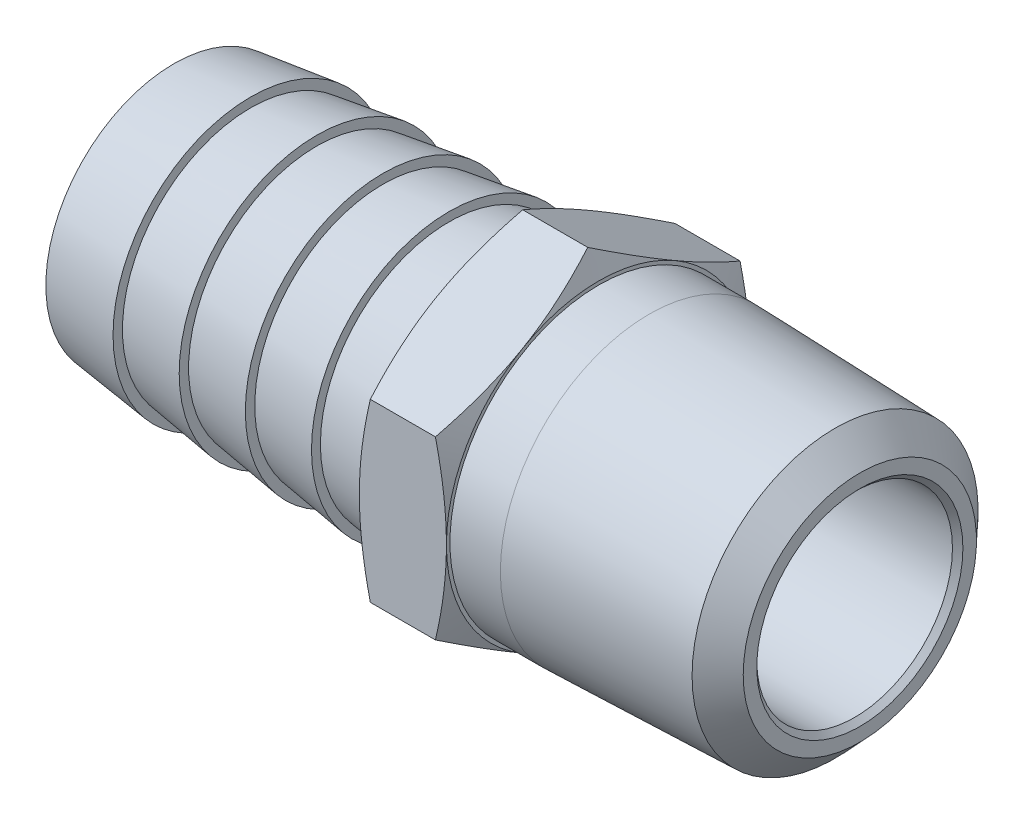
ISO-10303-21;
HEADER;
FILE_DESCRIPTION(('STEP AP214'),'2;1');
FILE_NAME('part.step','',(''),(''),'','','');
FILE_SCHEMA(('AUTOMOTIVE_DESIGN { 1 0 10303 214 1 1 1 1 }'));
ENDSEC;
DATA;
#1=APPLICATION_CONTEXT('core data for automotive mechanical design processes');
#2=APPLICATION_PROTOCOL_DEFINITION('international standard','automotive_design',2000,#1);
#3=PRODUCT_CONTEXT('',#1,'mechanical');
#4=PRODUCT('Part','Part','',(#3));
#5=PRODUCT_RELATED_PRODUCT_CATEGORY('part','',(#4));
#6=PRODUCT_DEFINITION_FORMATION('','',#4);
#7=PRODUCT_DEFINITION_CONTEXT('part definition',#1,'design');
#8=PRODUCT_DEFINITION('design','',#6,#7);
#9=PRODUCT_DEFINITION_SHAPE('','',#8);
#10=(LENGTH_UNIT() NAMED_UNIT(*) SI_UNIT(.MILLI.,.METRE.));
#11=(NAMED_UNIT(*) PLANE_ANGLE_UNIT() SI_UNIT($,.RADIAN.));
#12=(NAMED_UNIT(*) SI_UNIT($,.STERADIAN.) SOLID_ANGLE_UNIT());
#13=UNCERTAINTY_MEASURE_WITH_UNIT(LENGTH_MEASURE(1.E-05),#10,'distance_accuracy_value','');
#14=(GEOMETRIC_REPRESENTATION_CONTEXT(3) GLOBAL_UNCERTAINTY_ASSIGNED_CONTEXT((#13)) GLOBAL_UNIT_ASSIGNED_CONTEXT((#10,
#11,#12)) REPRESENTATION_CONTEXT('',''));
#15=CARTESIAN_POINT('',(0.,0.,0.));
#16=DIRECTION('',(0.,0.,1.));
#17=DIRECTION('',(1.,0.,0.));
#18=AXIS2_PLACEMENT_3D('',#15,#16,#17);
#19=CARTESIAN_POINT('',(24.6380000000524,0.,0.));
#20=DIRECTION('',(1.,0.,0.));
#21=DIRECTION('',(0.,0.,-1.));
#22=AXIS2_PLACEMENT_3D('',#19,#20,#21);
#23=CONICAL_SURFACE('',#22,10.0329999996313,0.141160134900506);
#24=CARTESIAN_POINT('',(24.6380000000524,0.,0.));
#25=DIRECTION('',(1.,0.,0.));
#26=DIRECTION('',(0.,0.,-1.));
#27=AXIS2_PLACEMENT_3D('',#24,#25,#26);
#28=CIRCLE('',#27,10.0329999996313);
#29=CARTESIAN_POINT('',(24.6380000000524,0.,-10.0329999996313));
#30=VERTEX_POINT('',#29);
#31=EDGE_CURVE('E17',#30,#30,#28,.F.);
#32=ORIENTED_EDGE('',*,*,#31,.T.);
#33=EDGE_LOOP('',(#32));
#34=FACE_BOUND('',#33,.T.);
#35=CARTESIAN_POINT('',(20.0659999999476,0.,0.));
#36=DIRECTION('',(1.,0.,0.));
#37=DIRECTION('',(0.,0.,-1.));
#38=AXIS2_PLACEMENT_3D('',#35,#36,#37);
#39=CIRCLE('',#38,9.38329473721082);
#40=CARTESIAN_POINT('',(20.0659999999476,0.,-9.38329473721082));
#41=VERTEX_POINT('',#40);
#42=EDGE_CURVE('E130',#41,#41,#39,.F.);
#43=ORIENTED_EDGE('',*,*,#42,.F.);
#44=EDGE_LOOP('',(#43));
#45=FACE_BOUND('',#44,.T.);
#46=ADVANCED_FACE('F14',(#34,#45),#23,.T.);
#47=CARTESIAN_POINT('',(24.638,0.,0.));
#48=DIRECTION('',(1.,0.,0.));
#49=DIRECTION('',(0.,0.,-1.));
#50=AXIS2_PLACEMENT_3D('',#47,#48,#49);
#51=PLANE('',#50);
#52=ORIENTED_EDGE('',*,*,#31,.F.);
#53=EDGE_LOOP('',(#52));
#54=FACE_BOUND('',#53,.T.);
#55=CARTESIAN_POINT('',(24.6379999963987,0.,0.));
#56=DIRECTION('',(1.,0.,0.));
#57=DIRECTION('',(0.,1.,0.));
#58=AXIS2_PLACEMENT_3D('',#55,#56,#57);
#59=CIRCLE('',#58,11.1125000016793);
#60=CARTESIAN_POINT('',(24.6379999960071,-9.62370730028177,5.55625000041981));
#61=VERTEX_POINT('',#60);
#62=CARTESIAN_POINT('',(24.6379999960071,-9.62370730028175,-5.55625000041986));
#63=VERTEX_POINT('',#62);
#64=EDGE_CURVE('E110',#61,#63,#59,.T.);
#65=ORIENTED_EDGE('',*,*,#64,.F.);
#66=CARTESIAN_POINT('',(24.6379999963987,0.,0.));
#67=DIRECTION('',(1.,0.,0.));
#68=DIRECTION('',(0.,1.,0.));
#69=AXIS2_PLACEMENT_3D('',#66,#67,#68);
#70=CIRCLE('',#69,11.1125000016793);
#71=CARTESIAN_POINT('',(24.6379999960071,0.,11.1125000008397));
#72=VERTEX_POINT('',#71);
#73=EDGE_CURVE('E507',#72,#61,#70,.T.);
#74=ORIENTED_EDGE('',*,*,#73,.F.);
#75=CARTESIAN_POINT('',(24.6379999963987,0.,0.));
#76=DIRECTION('',(1.,0.,0.));
#77=DIRECTION('',(0.,1.,0.));
#78=AXIS2_PLACEMENT_3D('',#75,#76,#77);
#79=CIRCLE('',#78,11.1125000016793);
#80=CARTESIAN_POINT('',(24.6379999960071,9.62370730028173,5.55625000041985));
#81=VERTEX_POINT('',#80);
#82=EDGE_CURVE('E509',#81,#72,#79,.T.);
#83=ORIENTED_EDGE('',*,*,#82,.F.);
#84=CARTESIAN_POINT('',(24.6379999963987,0.,0.));
#85=DIRECTION('',(1.,0.,0.));
#86=DIRECTION('',(0.,1.,0.));
#87=AXIS2_PLACEMENT_3D('',#84,#85,#86);
#88=CIRCLE('',#87,11.1125000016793);
#89=CARTESIAN_POINT('',(24.6379999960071,9.62370730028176,-5.55625000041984));
#90=VERTEX_POINT('',#89);
#91=EDGE_CURVE('E125',#90,#81,#88,.T.);
#92=ORIENTED_EDGE('',*,*,#91,.F.);
#93=CARTESIAN_POINT('',(24.6379999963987,0.,0.));
#94=DIRECTION('',(1.,0.,0.));
#95=DIRECTION('',(0.,1.,0.));
#96=AXIS2_PLACEMENT_3D('',#93,#94,#95);
#97=CIRCLE('',#96,11.1125000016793);
#98=CARTESIAN_POINT('',(24.6379999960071,0.,-11.1125000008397));
#99=VERTEX_POINT('',#98);
#100=EDGE_CURVE('E122',#99,#90,#97,.T.);
#101=ORIENTED_EDGE('',*,*,#100,.F.);
#102=CARTESIAN_POINT('',(24.6379999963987,0.,0.));
#103=DIRECTION('',(1.,0.,0.));
#104=DIRECTION('',(0.,0.,-1.));
#105=AXIS2_PLACEMENT_3D('',#102,#103,#104);
#106=CIRCLE('',#105,11.1125000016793);
#107=EDGE_CURVE('E100',#63,#99,#106,.T.);
#108=ORIENTED_EDGE('',*,*,#107,.F.);
#109=EDGE_LOOP('',(#65,#74,#83,#92,#101,#108));
#110=FACE_BOUND('',#109,.T.);
#111=ADVANCED_FACE('F123',(#54,#110),#51,.F.);
#112=CARTESIAN_POINT('',(20.066,9.70814736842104,0.));
#113=DIRECTION('',(1.,0.,0.));
#114=DIRECTION('',(0.,0.,-1.));
#115=AXIS2_PLACEMENT_3D('',#112,#113,#114);
#116=PLANE('',#115);
#117=ORIENTED_EDGE('',*,*,#42,.T.);
#118=EDGE_LOOP('',(#117));
#119=FACE_BOUND('',#118,.T.);
#120=CARTESIAN_POINT('',(20.0660000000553,0.,0.));
#121=DIRECTION('',(1.,0.,0.));
#122=DIRECTION('',(0.,1.,0.));
#123=AXIS2_PLACEMENT_3D('',#120,#121,#122);
#124=CIRCLE('',#123,10.0329999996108);
#125=CARTESIAN_POINT('',(20.0660000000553,10.0329999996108,0.));
#126=VERTEX_POINT('',#125);
#127=EDGE_CURVE('E109',#126,#126,#124,.F.);
#128=ORIENTED_EDGE('',*,*,#127,.F.);
#129=EDGE_LOOP('',(#128));
#130=FACE_BOUND('',#129,.T.);
#131=ADVANCED_FACE('F160',(#119,#130),#116,.T.);
#132=CARTESIAN_POINT('',(25.4444438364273,0.,0.));
#133=DIRECTION('',(1.,0.,0.));
#134=DIRECTION('',(0.,1.,0.));
#135=AXIS2_PLACEMENT_3D('',#132,#133,#134);
#136=CONICAL_SURFACE('',#135,12.8419243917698,1.1344640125);
#137=CARTESIAN_POINT('',(24.637999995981,0.,-11.1124999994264));
#138=CARTESIAN_POINT('',(24.6379678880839,0.270593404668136,-11.112499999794));
#139=CARTESIAN_POINT('',(24.6426080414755,0.541178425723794,-11.1124999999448));
#140=CARTESIAN_POINT('',(24.6609951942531,1.08200900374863,-11.1125000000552));
#141=CARTESIAN_POINT('',(24.6747411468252,1.35225459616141,-11.1125000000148));
#142=CARTESIAN_POINT('',(24.7110418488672,1.89124803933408,-11.1124999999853));
#143=CARTESIAN_POINT('',(24.7335671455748,2.15999788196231,-11.112499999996));
#144=CARTESIAN_POINT('',(24.7869902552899,2.69665532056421,-11.112500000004));
#145=CARTESIAN_POINT('',(24.8178881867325,2.96456290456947,-11.1125000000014));
#146=CARTESIAN_POINT('',(24.9223059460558,3.76633360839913,-11.1124999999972));
#147=CARTESIAN_POINT('',(25.0075822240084,4.29870236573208,-11.1124999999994));
#148=CARTESIAN_POINT('',(25.1554304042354,5.09436092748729,-11.1125000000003));
#149=CARTESIAN_POINT('',(25.2081460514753,5.35956296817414,-11.1125000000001));
#150=CARTESIAN_POINT('',(25.3195607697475,5.88865023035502,-11.1124999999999));
#151=CARTESIAN_POINT('',(25.3782585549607,6.15253572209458,-11.1124999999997));
#152=CARTESIAN_POINT('',(25.4396340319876,6.41580486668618,-11.1125));
#153=B_SPLINE_CURVE_WITH_KNOTS('',3,(#137,#138,#139,#140,#141,#142,#143,#144,#145,#146,#147,
#148,#149,#150,#151,#152),.UNSPECIFIED.,.F.,.F.,(4,2,2,2,2,2,2,4),(0.,0.811726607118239,
1.6233599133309,2.43229348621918,3.24123850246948,4.857754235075,5.6688770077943,
6.47982580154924),.UNSPECIFIED.);
#154=CARTESIAN_POINT('',(25.4396340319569,6.41580486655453,-11.1125));
#155=VERTEX_POINT('',#154);
#156=EDGE_CURVE('E115',#99,#155,#153,.T.);
#157=ORIENTED_EDGE('',*,*,#156,.F.);
#158=ORIENTED_EDGE('',*,*,#100,.T.);
#159=CARTESIAN_POINT('',(25.439634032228,6.415804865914,-11.1125000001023));
#160=CARTESIAN_POINT('',(25.3782585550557,6.54743943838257,-10.8845022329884));
#161=CARTESIAN_POINT('',(25.3195607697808,6.67938218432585,-10.6559706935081));
#162=CARTESIAN_POINT('',(25.2081460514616,6.94392581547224,-10.1977676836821));
#163=CARTESIAN_POINT('',(25.1554304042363,7.07652683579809,-9.96809597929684));
#164=CARTESIAN_POINT('',(25.0075822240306,7.47435611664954,-9.27903545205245));
#165=CARTESIAN_POINT('',(24.9223059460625,7.74054049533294,-8.81799058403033));
#166=CARTESIAN_POINT('',(24.8178881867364,8.14142584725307,-8.12363678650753));
#167=CARTESIAN_POINT('',(24.7869902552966,8.27537963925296,-7.89162201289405));
#168=CARTESIAN_POINT('',(24.7335671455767,8.54370835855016,-7.42686303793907));
#169=CARTESIAN_POINT('',(24.7110418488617,8.67808327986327,-7.19411884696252));
#170=CARTESIAN_POINT('',(24.6747411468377,8.94758000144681,-6.72733683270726));
#171=CARTESIAN_POINT('',(24.6609951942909,9.0827027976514,-6.49329728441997));
#172=CARTESIAN_POINT('',(24.642608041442,9.35311808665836,-6.02492426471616));
#173=CARTESIAN_POINT('',(24.6379678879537,9.48841059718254,-5.79059076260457));
#174=CARTESIAN_POINT('',(24.6379999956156,9.62370729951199,-5.55625000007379));
#175=B_SPLINE_CURVE_WITH_KNOTS('',3,(#159,#160,#161,#162,#163,#164,#165,#166,#167,#168,#169,
#170,#171,#172,#173,#174),.UNSPECIFIED.,.F.,.F.,(4,2,2,2,2,2,2,4),(0.,0.810948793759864,
1.62207156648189,3.23858729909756,4.0475323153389,4.85646588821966,5.66809919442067,
6.47982580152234),.UNSPECIFIED.);
#176=EDGE_CURVE('E133',#155,#90,#175,.T.);
#177=ORIENTED_EDGE('',*,*,#176,.F.);
#178=EDGE_LOOP('',(#157,#158,#177));
#179=FACE_BOUND('',#178,.T.);
#180=ADVANCED_FACE('F132',(#179),#136,.T.);
#181=CARTESIAN_POINT('',(25.4444438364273,0.,0.));
#182=DIRECTION('',(1.,0.,0.));
#183=DIRECTION('',(0.,1.,0.));
#184=AXIS2_PLACEMENT_3D('',#181,#182,#183);
#185=CONICAL_SURFACE('',#184,12.8419243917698,1.1344640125);
#186=CARTESIAN_POINT('',(24.637999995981,9.62370729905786,-5.55624999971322));
#187=CARTESIAN_POINT('',(24.6379678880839,9.75900400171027,-5.3219092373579));
#188=CARTESIAN_POINT('',(24.6426080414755,9.89429651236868,-5.08757573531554));
#189=CARTESIAN_POINT('',(24.6609951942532,10.1647118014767,-4.6192027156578));
#190=CARTESIAN_POINT('',(24.6747411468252,10.2998345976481,-4.38516316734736));
#191=CARTESIAN_POINT('',(24.7110418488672,10.5693313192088,-3.91838115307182));
#192=CARTESIAN_POINT('',(24.7335671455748,10.7037062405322,-3.68563696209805));
#193=CARTESIAN_POINT('',(24.78699025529,10.9720349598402,-3.22087798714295));
#194=CARTESIAN_POINT('',(24.8178881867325,11.1059887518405,-2.98886321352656));
#195=CARTESIAN_POINT('',(24.9223059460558,11.5068741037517,-2.29450941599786));
#196=CARTESIAN_POINT('',(25.0075822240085,11.7730584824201,-1.83346454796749));
#197=CARTESIAN_POINT('',(25.1554304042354,12.1708877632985,-1.14440402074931));
#198=CARTESIAN_POINT('',(25.2081460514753,12.3034887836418,-0.914732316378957));
#199=CARTESIAN_POINT('',(25.3195607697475,12.568032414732,-0.456529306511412));
#200=CARTESIAN_POINT('',(25.3782585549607,12.6999751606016,-0.227997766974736));
#201=CARTESIAN_POINT('',(25.4396340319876,12.8316097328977,2.74046882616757E-10));
#202=B_SPLINE_CURVE_WITH_KNOTS('',3,(#186,#187,#188,#189,#190,#191,#192,#193,#194,#195,#196,
#197,#198,#199,#200,#201),.UNSPECIFIED.,.F.,.F.,(4,2,2,2,2,2,2,4),(0.,0.811726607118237,
1.62335991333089,2.43229348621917,3.24123850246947,4.85775423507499,5.66887700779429,
6.47982580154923),.UNSPECIFIED.);
#203=CARTESIAN_POINT('',(25.4396340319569,12.8316097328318,1.6003927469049E-10));
#204=VERTEX_POINT('',#203);
#205=EDGE_CURVE('E479',#90,#204,#202,.T.);
#206=ORIENTED_EDGE('',*,*,#205,.F.);
#207=ORIENTED_EDGE('',*,*,#91,.T.);
#208=CARTESIAN_POINT('',(25.439634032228,12.8316097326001,-4.45810840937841E-10));
#209=CARTESIAN_POINT('',(25.3782585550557,12.6999751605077,0.227997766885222));
#210=CARTESIAN_POINT('',(25.3195607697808,12.5680324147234,0.456529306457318));
#211=CARTESIAN_POINT('',(25.2081460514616,12.3034887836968,0.914732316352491));
#212=CARTESIAN_POINT('',(25.1554304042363,12.1708877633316,1.14440402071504));
#213=CARTESIAN_POINT('',(25.0075822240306,11.7730584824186,1.83346454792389));
#214=CARTESIAN_POINT('',(24.9223059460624,11.5068741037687,2.29450941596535));
#215=CARTESIAN_POINT('',(24.8178881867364,11.1059887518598,2.98886321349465));
#216=CARTESIAN_POINT('',(24.7869902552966,10.9720349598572,3.22087798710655));
#217=CARTESIAN_POINT('',(24.7335671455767,10.703706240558,3.68563696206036));
#218=CARTESIAN_POINT('',(24.7110418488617,10.5693313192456,3.91838115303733));
#219=CARTESIAN_POINT('',(24.6747411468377,10.2998345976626,4.38516316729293));
#220=CARTESIAN_POINT('',(24.6609951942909,10.1647118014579,4.61920271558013));
#221=CARTESIAN_POINT('',(24.642608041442,9.89429651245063,5.08757573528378));
#222=CARTESIAN_POINT('',(24.6379678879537,9.75900400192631,5.32190923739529));
#223=CARTESIAN_POINT('',(24.6379999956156,9.62370729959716,5.55624999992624));
#224=B_SPLINE_CURVE_WITH_KNOTS('',3,(#208,#209,#210,#211,#212,#213,#214,#215,#216,#217,#218,
#219,#220,#221,#222,#223),.UNSPECIFIED.,.F.,.F.,(4,2,2,2,2,2,2,4),(0.,0.810948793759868,
1.6220715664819,3.23858729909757,4.04753231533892,4.85646588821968,5.66809919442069,
6.47982580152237),.UNSPECIFIED.);
#225=EDGE_CURVE('E326',#204,#81,#224,.T.);
#226=ORIENTED_EDGE('',*,*,#225,.F.);
#227=EDGE_LOOP('',(#206,#207,#226));
#228=FACE_BOUND('',#227,.T.);
#229=ADVANCED_FACE('F159',(#228),#185,.T.);
#230=CARTESIAN_POINT('',(25.4444438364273,0.,0.));
#231=DIRECTION('',(1.,0.,0.));
#232=DIRECTION('',(0.,1.,0.));
#233=AXIS2_PLACEMENT_3D('',#230,#231,#232);
#234=CONICAL_SURFACE('',#233,12.8419243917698,1.1344640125);
#235=CARTESIAN_POINT('',(24.637999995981,9.62370729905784,5.55624999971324));
#236=CARTESIAN_POINT('',(24.6379678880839,9.48841059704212,5.79059076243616));
#237=CARTESIAN_POINT('',(24.6426080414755,9.35311808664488,6.02492426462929));
#238=CARTESIAN_POINT('',(24.6609951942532,9.08270279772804,6.4932972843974));
#239=CARTESIAN_POINT('',(24.6747411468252,8.94758000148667,6.72733683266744));
#240=CARTESIAN_POINT('',(24.7110418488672,8.67808327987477,7.19411884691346));
#241=CARTESIAN_POINT('',(24.7335671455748,8.54370835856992,7.42686303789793));
#242=CARTESIAN_POINT('',(24.7869902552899,8.27537963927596,7.89162201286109));
#243=CARTESIAN_POINT('',(24.8178881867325,8.14142584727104,8.12363678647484));
#244=CARTESIAN_POINT('',(24.9223059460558,7.7405404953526,8.81799058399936));
#245=CARTESIAN_POINT('',(25.0075822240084,7.47435611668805,9.27903545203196));
#246=CARTESIAN_POINT('',(25.1554304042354,7.07652683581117,9.96809597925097));
#247=CARTESIAN_POINT('',(25.2081460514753,6.94392581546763,10.1977676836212));
#248=CARTESIAN_POINT('',(25.3195607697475,6.67938218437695,10.6559706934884));
#249=CARTESIAN_POINT('',(25.3782585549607,6.54743943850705,10.884502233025));
#250=CARTESIAN_POINT('',(25.4396340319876,6.41580486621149,11.112500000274));
#251=B_SPLINE_CURVE_WITH_KNOTS('',3,(#235,#236,#237,#238,#239,#240,#241,#242,#243,#244,#245,
#246,#247,#248,#249,#250),.UNSPECIFIED.,.F.,.F.,(4,2,2,2,2,2,2,4),(0.,0.811726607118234,
1.62335991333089,2.43229348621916,3.24123850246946,4.85775423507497,5.66887700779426,
6.4798258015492),.UNSPECIFIED.);
#252=CARTESIAN_POINT('',(25.4396340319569,6.41580486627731,11.11250000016));
#253=VERTEX_POINT('',#252);
#254=EDGE_CURVE('E321',#81,#253,#251,.T.);
#255=ORIENTED_EDGE('',*,*,#254,.F.);
#256=ORIENTED_EDGE('',*,*,#82,.T.);
#257=CARTESIAN_POINT('',(25.4396340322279,6.41580486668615,11.1124999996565));
#258=CARTESIAN_POINT('',(25.3782585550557,6.1525357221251,11.1124999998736));
#259=CARTESIAN_POINT('',(25.3195607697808,5.88865023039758,11.1124999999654));
#260=CARTESIAN_POINT('',(25.2081460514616,5.35956296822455,11.1125000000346));
#261=CARTESIAN_POINT('',(25.1554304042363,5.09436092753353,11.1125000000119));
#262=CARTESIAN_POINT('',(25.0075822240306,4.29870236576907,11.1124999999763));
#263=CARTESIAN_POINT('',(24.9223059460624,3.76633360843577,11.1124999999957));
#264=CARTESIAN_POINT('',(24.8178881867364,2.96456290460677,11.1125000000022));
#265=CARTESIAN_POINT('',(24.7869902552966,2.69665532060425,11.1125000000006));
#266=CARTESIAN_POINT('',(24.7335671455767,2.15999788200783,11.1124999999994));
#267=CARTESIAN_POINT('',(24.7110418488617,1.89124803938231,11.1124999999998));
#268=CARTESIAN_POINT('',(24.6747411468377,1.35225459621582,11.1125000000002));
#269=CARTESIAN_POINT('',(24.6609951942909,1.0820090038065,11.1125000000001));
#270=CARTESIAN_POINT('',(24.642608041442,0.541178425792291,11.1124999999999));
#271=CARTESIAN_POINT('',(24.6379678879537,0.270593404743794,11.1124999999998));
#272=CARTESIAN_POINT('',(24.6379999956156,8.51970177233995E-11,11.1125));
#273=B_SPLINE_CURVE_WITH_KNOTS('',3,(#257,#258,#259,#260,#261,#262,#263,#264,#265,#266,#267,
#268,#269,#270,#271,#272),.UNSPECIFIED.,.F.,.F.,(4,2,2,2,2,2,2,4),(0.,0.810948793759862,
1.62207156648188,3.23858729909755,4.04753231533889,4.85646588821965,5.66809919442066,
6.47982580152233),.UNSPECIFIED.);
#274=EDGE_CURVE('E314',#253,#72,#273,.T.);
#275=ORIENTED_EDGE('',*,*,#274,.F.);
#276=EDGE_LOOP('',(#255,#256,#275));
#277=FACE_BOUND('',#276,.T.);
#278=ADVANCED_FACE('F304',(#277),#234,.T.);
#279=CARTESIAN_POINT('',(25.4444438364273,0.,0.));
#280=DIRECTION('',(1.,0.,0.));
#281=DIRECTION('',(0.,1.,0.));
#282=AXIS2_PLACEMENT_3D('',#279,#280,#281);
#283=CONICAL_SURFACE('',#282,12.8419243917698,1.1344640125);
#284=ORIENTED_EDGE('',*,*,#73,.T.);
#285=CARTESIAN_POINT('',(25.439634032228,-6.41580486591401,11.1125000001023));
#286=CARTESIAN_POINT('',(25.3782585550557,-6.54743943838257,10.8845022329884));
#287=CARTESIAN_POINT('',(25.3195607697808,-6.67938218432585,10.6559706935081));
#288=CARTESIAN_POINT('',(25.2081460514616,-6.94392581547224,10.1977676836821));
#289=CARTESIAN_POINT('',(25.1554304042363,-7.07652683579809,9.96809597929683));
#290=CARTESIAN_POINT('',(25.0075822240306,-7.47435611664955,9.27903545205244));
#291=CARTESIAN_POINT('',(24.9223059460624,-7.74054049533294,8.81799058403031));
#292=CARTESIAN_POINT('',(24.8178881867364,-8.14142584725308,8.12363678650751));
#293=CARTESIAN_POINT('',(24.7869902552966,-8.27537963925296,7.89162201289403));
#294=CARTESIAN_POINT('',(24.7335671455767,-8.54370835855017,7.42686303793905));
#295=CARTESIAN_POINT('',(24.7110418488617,-8.67808327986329,7.19411884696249));
#296=CARTESIAN_POINT('',(24.6747411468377,-8.94758000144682,6.72733683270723));
#297=CARTESIAN_POINT('',(24.6609951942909,-9.08270279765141,6.49329728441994));
#298=CARTESIAN_POINT('',(24.642608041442,-9.35311808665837,6.02492426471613));
#299=CARTESIAN_POINT('',(24.6379678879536,-9.48841059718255,5.79059076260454));
#300=CARTESIAN_POINT('',(24.6379999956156,-9.62370729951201,5.55625000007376));
#301=B_SPLINE_CURVE_WITH_KNOTS('',3,(#285,#286,#287,#288,#289,#290,#291,#292,#293,#294,#295,
#296,#297,#298,#299,#300),.UNSPECIFIED.,.F.,.F.,(4,2,2,2,2,2,2,4),(0.,0.810948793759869,
1.6220715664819,3.23858729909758,4.04753231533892,4.85646588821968,5.6680991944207,
6.47982580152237),.UNSPECIFIED.);
#302=CARTESIAN_POINT('',(25.4396340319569,-6.41580486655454,11.1125));
#303=VERTEX_POINT('',#302);
#304=EDGE_CURVE('E284',#303,#61,#301,.T.);
#305=ORIENTED_EDGE('',*,*,#304,.F.);
#306=CARTESIAN_POINT('',(24.637999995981,0.,11.1124999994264));
#307=CARTESIAN_POINT('',(24.6379678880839,-0.270593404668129,11.112499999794));
#308=CARTESIAN_POINT('',(24.6426080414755,-0.541178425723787,11.1124999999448));
#309=CARTESIAN_POINT('',(24.6609951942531,-1.08200900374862,11.1125000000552));
#310=CARTESIAN_POINT('',(24.6747411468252,-1.3522545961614,11.1125000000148));
#311=CARTESIAN_POINT('',(24.7110418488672,-1.89124803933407,11.1124999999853));
#312=CARTESIAN_POINT('',(24.7335671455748,-2.15999788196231,11.112499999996));
#313=CARTESIAN_POINT('',(24.7869902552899,-2.6966553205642,11.112500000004));
#314=CARTESIAN_POINT('',(24.8178881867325,-2.96456290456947,11.1125000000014));
#315=CARTESIAN_POINT('',(24.9223059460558,-3.76633360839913,11.1124999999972));
#316=CARTESIAN_POINT('',(25.0075822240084,-4.29870236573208,11.1124999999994));
#317=CARTESIAN_POINT('',(25.1554304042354,-5.09436092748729,11.1125000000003));
#318=CARTESIAN_POINT('',(25.2081460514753,-5.35956296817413,11.1125000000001));
#319=CARTESIAN_POINT('',(25.3195607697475,-5.88865023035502,11.1124999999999));
#320=CARTESIAN_POINT('',(25.3782585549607,-6.15253572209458,11.1124999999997));
#321=CARTESIAN_POINT('',(25.4396340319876,-6.41580486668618,11.1125));
#322=B_SPLINE_CURVE_WITH_KNOTS('',3,(#306,#307,#308,#309,#310,#311,#312,#313,#314,#315,#316,
#317,#318,#319,#320,#321),.UNSPECIFIED.,.F.,.F.,(4,2,2,2,2,2,2,4),(0.,0.811726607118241,
1.6233599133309,2.43229348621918,3.24123850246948,4.85775423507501,5.6688770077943,
6.47982580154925),.UNSPECIFIED.);
#323=EDGE_CURVE('E308',#72,#303,#322,.T.);
#324=ORIENTED_EDGE('',*,*,#323,.F.);
#325=EDGE_LOOP('',(#284,#305,#324));
#326=FACE_BOUND('',#325,.T.);
#327=ADVANCED_FACE('F298',(#326),#283,.T.);
#328=CARTESIAN_POINT('',(25.4444438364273,0.,0.));
#329=DIRECTION('',(1.,0.,0.));
#330=DIRECTION('',(0.,1.,0.));
#331=AXIS2_PLACEMENT_3D('',#328,#329,#330);
#332=CONICAL_SURFACE('',#331,12.8419243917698,1.1344640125);
#333=ORIENTED_EDGE('',*,*,#64,.T.);
#334=CARTESIAN_POINT('',(25.439634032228,-12.8316097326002,4.45789123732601E-10));
#335=CARTESIAN_POINT('',(25.3782585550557,-12.6999751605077,-0.227997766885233));
#336=CARTESIAN_POINT('',(25.3195607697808,-12.5680324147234,-0.456529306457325));
#337=CARTESIAN_POINT('',(25.2081460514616,-12.3034887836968,-0.914732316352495));
#338=CARTESIAN_POINT('',(25.1554304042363,-12.1708877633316,-1.14440402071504));
#339=CARTESIAN_POINT('',(25.0075822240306,-11.7730584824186,-1.83346454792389));
#340=CARTESIAN_POINT('',(24.9223059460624,-11.5068741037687,-2.29450941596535));
#341=CARTESIAN_POINT('',(24.8178881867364,-11.1059887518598,-2.98886321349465));
#342=CARTESIAN_POINT('',(24.7869902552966,-10.9720349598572,-3.22087798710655));
#343=CARTESIAN_POINT('',(24.7335671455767,-10.703706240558,-3.68563696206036));
#344=CARTESIAN_POINT('',(24.7110418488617,-10.5693313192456,-3.91838115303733));
#345=CARTESIAN_POINT('',(24.6747411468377,-10.2998345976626,-4.38516316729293));
#346=CARTESIAN_POINT('',(24.6609951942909,-10.1647118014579,-4.61920271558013));
#347=CARTESIAN_POINT('',(24.642608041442,-9.89429651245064,-5.08757573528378));
#348=CARTESIAN_POINT('',(24.6379678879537,-9.75900400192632,-5.32190923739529));
#349=CARTESIAN_POINT('',(24.6379999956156,-9.62370729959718,-5.55624999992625));
#350=B_SPLINE_CURVE_WITH_KNOTS('',3,(#334,#335,#336,#337,#338,#339,#340,#341,#342,#343,#344,
#345,#346,#347,#348,#349),.UNSPECIFIED.,.F.,.F.,(4,2,2,2,2,2,2,4),(0.,0.810948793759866,
1.6220715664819,3.23858729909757,4.04753231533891,4.85646588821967,5.66809919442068,
6.47982580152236),.UNSPECIFIED.);
#351=CARTESIAN_POINT('',(25.4396340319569,-12.8316097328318,-1.60065118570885E-10));
#352=VERTEX_POINT('',#351);
#353=EDGE_CURVE('E285',#352,#63,#350,.T.);
#354=ORIENTED_EDGE('',*,*,#353,.F.);
#355=CARTESIAN_POINT('',(24.637999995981,-9.62370729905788,5.55624999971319));
#356=CARTESIAN_POINT('',(24.6379678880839,-9.75900400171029,5.32190923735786));
#357=CARTESIAN_POINT('',(24.6426080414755,-9.89429651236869,5.08757573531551));
#358=CARTESIAN_POINT('',(24.6609951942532,-10.1647118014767,4.61920271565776));
#359=CARTESIAN_POINT('',(24.6747411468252,-10.2998345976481,4.38516316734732));
#360=CARTESIAN_POINT('',(24.7110418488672,-10.5693313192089,3.91838115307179));
#361=CARTESIAN_POINT('',(24.7335671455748,-10.7037062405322,3.68563696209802));
#362=CARTESIAN_POINT('',(24.7869902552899,-10.9720349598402,3.22087798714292));
#363=CARTESIAN_POINT('',(24.8178881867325,-11.1059887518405,2.98886321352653));
#364=CARTESIAN_POINT('',(24.9223059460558,-11.5068741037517,2.29450941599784));
#365=CARTESIAN_POINT('',(25.0075822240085,-11.7730584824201,1.83346454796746));
#366=CARTESIAN_POINT('',(25.1554304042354,-12.1708877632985,1.14440402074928));
#367=CARTESIAN_POINT('',(25.2081460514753,-12.3034887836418,0.914732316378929));
#368=CARTESIAN_POINT('',(25.3195607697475,-12.568032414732,0.456529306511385));
#369=CARTESIAN_POINT('',(25.3782585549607,-12.6999751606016,0.227997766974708));
#370=CARTESIAN_POINT('',(25.4396340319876,-12.8316097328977,-2.74076077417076E-10));
#371=B_SPLINE_CURVE_WITH_KNOTS('',3,(#355,#356,#357,#358,#359,#360,#361,#362,#363,#364,#365,
#366,#367,#368,#369,#370),.UNSPECIFIED.,.F.,.F.,(4,2,2,2,2,2,2,4),(0.,0.811726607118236,
1.62335991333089,2.43229348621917,3.24123850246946,4.85775423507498,5.66887700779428,
6.47982580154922),.UNSPECIFIED.);
#372=EDGE_CURVE('E277',#61,#352,#371,.T.);
#373=ORIENTED_EDGE('',*,*,#372,.F.);
#374=EDGE_LOOP('',(#333,#354,#373));
#375=FACE_BOUND('',#374,.T.);
#376=ADVANCED_FACE('F295',(#375),#332,.T.);
#377=CARTESIAN_POINT('',(25.4444438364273,0.,0.));
#378=DIRECTION('',(1.,0.,0.));
#379=DIRECTION('',(0.,0.,-1.));
#380=AXIS2_PLACEMENT_3D('',#377,#378,#379);
#381=CONICAL_SURFACE('',#380,12.8419243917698,1.1344640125);
#382=ORIENTED_EDGE('',*,*,#107,.T.);
#383=CARTESIAN_POINT('',(25.4396340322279,-6.41580486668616,-11.1124999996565));
#384=CARTESIAN_POINT('',(25.3782585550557,-6.15253572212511,-11.1124999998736));
#385=CARTESIAN_POINT('',(25.3195607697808,-5.88865023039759,-11.1124999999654));
#386=CARTESIAN_POINT('',(25.2081460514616,-5.35956296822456,-11.1125000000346));
#387=CARTESIAN_POINT('',(25.1554304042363,-5.09436092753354,-11.1125000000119));
#388=CARTESIAN_POINT('',(25.0075822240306,-4.29870236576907,-11.1124999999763));
#389=CARTESIAN_POINT('',(24.9223059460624,-3.76633360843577,-11.1124999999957));
#390=CARTESIAN_POINT('',(24.8178881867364,-2.96456290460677,-11.1125000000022));
#391=CARTESIAN_POINT('',(24.7869902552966,-2.69665532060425,-11.1125000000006));
#392=CARTESIAN_POINT('',(24.7335671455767,-2.15999788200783,-11.1124999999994));
#393=CARTESIAN_POINT('',(24.7110418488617,-1.89124803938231,-11.1124999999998));
#394=CARTESIAN_POINT('',(24.6747411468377,-1.35225459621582,-11.1125000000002));
#395=CARTESIAN_POINT('',(24.6609951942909,-1.0820090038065,-11.1125000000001));
#396=CARTESIAN_POINT('',(24.642608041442,-0.541178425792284,-11.1124999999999));
#397=CARTESIAN_POINT('',(24.6379678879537,-0.270593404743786,-11.1124999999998));
#398=CARTESIAN_POINT('',(24.6379999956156,-8.51884059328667E-11,-11.1125));
#399=B_SPLINE_CURVE_WITH_KNOTS('',3,(#383,#384,#385,#386,#387,#388,#389,#390,#391,#392,#393,
#394,#395,#396,#397,#398),.UNSPECIFIED.,.F.,.F.,(4,2,2,2,2,2,2,4),(0.,0.810948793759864,
1.62207156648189,3.23858729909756,4.0475323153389,4.85646588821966,5.66809919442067,
6.47982580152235),.UNSPECIFIED.);
#400=CARTESIAN_POINT('',(25.439634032,-6.41580486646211,-11.11250000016));
#401=VERTEX_POINT('',#400);
#402=EDGE_CURVE('E103',#401,#99,#399,.T.);
#403=ORIENTED_EDGE('',*,*,#402,.F.);
#404=CARTESIAN_POINT('',(24.637999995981,-9.62370729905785,-5.55624999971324));
#405=CARTESIAN_POINT('',(24.6379678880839,-9.48841059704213,-5.79059076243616));
#406=CARTESIAN_POINT('',(24.6426080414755,-9.35311808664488,-6.02492426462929));
#407=CARTESIAN_POINT('',(24.6609951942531,-9.08270279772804,-6.4932972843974));
#408=CARTESIAN_POINT('',(24.6747411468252,-8.94758000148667,-6.72733683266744));
#409=CARTESIAN_POINT('',(24.7110418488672,-8.67808327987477,-7.19411884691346));
#410=CARTESIAN_POINT('',(24.7335671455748,-8.54370835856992,-7.42686303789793));
#411=CARTESIAN_POINT('',(24.7869902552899,-8.27537963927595,-7.89162201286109));
#412=CARTESIAN_POINT('',(24.8178881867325,-8.14142584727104,-8.12363678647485));
#413=CARTESIAN_POINT('',(24.9223059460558,-7.7405404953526,-8.81799058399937));
#414=CARTESIAN_POINT('',(25.0075822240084,-7.47435611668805,-9.27903545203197));
#415=CARTESIAN_POINT('',(25.1554304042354,-7.07652683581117,-9.96809597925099));
#416=CARTESIAN_POINT('',(25.2081460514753,-6.94392581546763,-10.1977676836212));
#417=CARTESIAN_POINT('',(25.3195607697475,-6.67938218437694,-10.6559706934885));
#418=CARTESIAN_POINT('',(25.3782585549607,-6.54743943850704,-10.884502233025));
#419=CARTESIAN_POINT('',(25.4396340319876,-6.41580486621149,-11.1125000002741));
#420=B_SPLINE_CURVE_WITH_KNOTS('',3,(#404,#405,#406,#407,#408,#409,#410,#411,#412,#413,#414,
#415,#416,#417,#418,#419),.UNSPECIFIED.,.F.,.F.,(4,2,2,2,2,2,2,4),(0.,0.811726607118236,
1.62335991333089,2.43229348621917,3.24123850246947,4.85775423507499,5.66887700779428,
6.47982580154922),.UNSPECIFIED.);
#421=EDGE_CURVE('E105',#63,#401,#420,.T.);
#422=ORIENTED_EDGE('',*,*,#421,.F.);
#423=EDGE_LOOP('',(#382,#403,#422));
#424=FACE_BOUND('',#423,.T.);
#425=ADVANCED_FACE('F102',(#424),#381,.T.);
#426=CARTESIAN_POINT('',(20.0660000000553,0.,0.));
#427=DIRECTION('',(1.,0.,0.));
#428=DIRECTION('',(0.,1.,0.));
#429=AXIS2_PLACEMENT_3D('',#426,#427,#428);
#430=CONICAL_SURFACE('',#429,10.0329999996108,0.141160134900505);
#431=ORIENTED_EDGE('',*,*,#127,.T.);
#432=EDGE_LOOP('',(#431));
#433=FACE_BOUND('',#432,.T.);
#434=CARTESIAN_POINT('',(15.2399999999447,0.,0.));
#435=DIRECTION('',(1.,0.,0.));
#436=DIRECTION('',(0.,1.,0.));
#437=AXIS2_PLACEMENT_3D('',#434,#435,#436);
#438=CIRCLE('',#437,9.34720000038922);
#439=CARTESIAN_POINT('',(15.2399999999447,9.34720000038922,0.));
#440=VERTEX_POINT('',#439);
#441=EDGE_CURVE('E427',#440,#440,#438,.F.);
#442=ORIENTED_EDGE('',*,*,#441,.F.);
#443=EDGE_LOOP('',(#442));
#444=FACE_BOUND('',#443,.T.);
#445=ADVANCED_FACE('F521',(#433,#444),#430,.T.);
#446=CARTESIAN_POINT('',(24.638,6.41580486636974,-11.1125));
#447=DIRECTION('',(0.,0.,-1.));
#448=DIRECTION('',(-1.,0.,0.));
#449=AXIS2_PLACEMENT_3D('',#446,#447,#448);
#450=PLANE('',#449);
#451=ORIENTED_EDGE('',*,*,#156,.T.);
#452=DIRECTION('',(1.,0.,0.));
#453=VECTOR('',#452,1.);
#454=CARTESIAN_POINT('',(24.638,6.41580486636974,-11.1125));
#455=LINE('',#454,#453);
#456=CARTESIAN_POINT('',(30.1863659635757,6.41580488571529,-11.1125));
#457=VERTEX_POINT('',#456);
#458=EDGE_CURVE('E134',#457,#155,#455,.F.);
#459=ORIENTED_EDGE('',*,*,#458,.F.);
#460=CARTESIAN_POINT('',(30.988000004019,0.,-11.1124999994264));
#461=CARTESIAN_POINT('',(30.9880321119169,0.270593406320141,-11.112499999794));
#462=CARTESIAN_POINT('',(30.9833919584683,0.54117842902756,-11.1124999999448));
#463=CARTESIAN_POINT('',(30.9650048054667,1.08200901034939,-11.1125000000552));
#464=CARTESIAN_POINT('',(30.9512588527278,1.35225460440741,-11.1125000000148));
#465=CARTESIAN_POINT('',(30.9149581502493,1.89124805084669,-11.1124999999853));
#466=CARTESIAN_POINT('',(30.8924328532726,2.15999789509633,-11.112499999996));
#467=CARTESIAN_POINT('',(30.8390097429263,2.69665533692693,-11.112500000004));
#468=CARTESIAN_POINT('',(30.8081118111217,2.96456292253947,-11.1125000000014));
#469=CARTESIAN_POINT('',(30.7036940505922,3.76633363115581,-11.1124999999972));
#470=CARTESIAN_POINT('',(30.6184177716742,4.29870239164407,-11.1124999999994));
#471=CARTESIAN_POINT('',(30.4705695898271,5.0943609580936,-11.1125000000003));
#472=CARTESIAN_POINT('',(30.4178539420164,5.3595630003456,-11.1125000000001));
#473=CARTESIAN_POINT('',(30.3064392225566,5.88865026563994,-11.1124999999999));
#474=CARTESIAN_POINT('',(30.2477414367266,6.15253575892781,-11.1124999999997));
#475=CARTESIAN_POINT('',(30.1863659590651,6.41580490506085,-11.1125));
#476=B_SPLINE_CURVE_WITH_KNOTS('',3,(#460,#461,#462,#463,#464,#465,#466,#467,#468,#469,#470,
#471,#472,#473,#474,#475),.UNSPECIFIED.,.F.,.F.,(4,2,2,2,2,2,2,4),(0.,0.811726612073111,
1.62335992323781,2.4322935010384,3.24123852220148,4.85775426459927,5.66887704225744,
6.47982584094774),.UNSPECIFIED.);
#477=CARTESIAN_POINT('',(30.9880000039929,0.,-11.1125000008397));
#478=VERTEX_POINT('',#477);
#479=EDGE_CURVE('E384',#478,#457,#476,.T.);
#480=ORIENTED_EDGE('',*,*,#479,.F.);
#481=CARTESIAN_POINT('',(30.1863659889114,-6.41580477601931,-11.1124999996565));
#482=CARTESIAN_POINT('',(30.2477414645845,-6.15253563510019,-11.1124999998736));
#483=CARTESIAN_POINT('',(30.3064392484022,-5.88865014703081,-11.1124999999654));
#484=CARTESIAN_POINT('',(30.4178539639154,-5.35956289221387,-11.1125000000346));
#485=CARTESIAN_POINT('',(30.470569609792,-5.09436085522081,-11.1125000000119));
#486=CARTESIAN_POINT('',(30.6184177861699,-4.2987023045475,-11.1124999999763));
#487=CARTESIAN_POINT('',(30.7036940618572,-3.76633355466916,-11.1124999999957));
#488=CARTESIAN_POINT('',(30.8081118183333,-2.96456286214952,-11.1125000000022));
#489=CARTESIAN_POINT('',(30.8390097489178,-2.69665528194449,-11.1125000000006));
#490=CARTESIAN_POINT('',(30.8924328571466,-2.15999785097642,-11.1124999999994));
#491=CARTESIAN_POINT('',(30.9149581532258,-1.89124801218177,-11.1124999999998));
#492=CARTESIAN_POINT('',(30.9512588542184,-1.3522545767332,-11.1125000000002));
#493=CARTESIAN_POINT('',(30.965004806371,-1.08200898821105,-11.1125000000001));
#494=CARTESIAN_POINT('',(30.9833919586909,-0.541178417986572,-11.1124999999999));
#495=CARTESIAN_POINT('',(30.9880321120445,-0.270593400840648,-11.1124999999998));
#496=CARTESIAN_POINT('',(30.9880000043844,-8.51767485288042E-11,-11.1125));
#497=B_SPLINE_CURVE_WITH_KNOTS('',3,(#481,#482,#483,#484,#485,#486,#487,#488,#489,#490,#491,
#492,#493,#494,#495,#496),.UNSPECIFIED.,.F.,.F.,(4,2,2,2,2,2,2,4),(0.,0.810948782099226,
1.62207154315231,3.23858725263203,4.04753225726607,4.85646581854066,5.6680991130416,
6.47982570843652),.UNSPECIFIED.);
#498=CARTESIAN_POINT('',(30.1863659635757,-6.41580485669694,-11.1125000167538));
#499=VERTEX_POINT('',#498);
#500=EDGE_CURVE('E406',#499,#478,#497,.T.);
#501=ORIENTED_EDGE('',*,*,#500,.F.);
#502=DIRECTION('',(1.,0.,0.));
#503=VECTOR('',#502,1.);
#504=CARTESIAN_POINT('',(24.638,-6.41580486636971,-11.1125));
#505=LINE('',#504,#503);
#506=EDGE_CURVE('E118',#401,#499,#505,.T.);
#507=ORIENTED_EDGE('',*,*,#506,.F.);
#508=ORIENTED_EDGE('',*,*,#402,.T.);
#509=EDGE_LOOP('',(#451,#459,#480,#501,#507,#508));
#510=FACE_BOUND('',#509,.T.);
#511=ADVANCED_FACE('F113',(#510),#450,.T.);
#512=CARTESIAN_POINT('',(24.638,12.8316097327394,0.));
#513=DIRECTION('',(0.,0.866025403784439,-0.5));
#514=DIRECTION('',(0.,0.5,0.866025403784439));
#515=AXIS2_PLACEMENT_3D('',#512,#513,#514);
#516=PLANE('',#515);
#517=ORIENTED_EDGE('',*,*,#205,.T.);
#518=DIRECTION('',(1.,0.,0.));
#519=VECTOR('',#518,1.);
#520=CARTESIAN_POINT('',(24.638,12.8316097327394,0.));
#521=LINE('',#520,#519);
#522=CARTESIAN_POINT('',(30.1863659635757,12.8316097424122,1.67537474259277E-08));
#523=VERTEX_POINT('',#522);
#524=EDGE_CURVE('E476',#523,#204,#521,.F.);
#525=ORIENTED_EDGE('',*,*,#524,.F.);
#526=CARTESIAN_POINT('',(30.988000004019,9.62370729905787,-5.55624999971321));
#527=CARTESIAN_POINT('',(30.9880321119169,9.75900400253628,-5.32190923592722));
#528=CARTESIAN_POINT('',(30.9833919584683,9.89429651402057,-5.08757573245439));
#529=CARTESIAN_POINT('',(30.9650048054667,10.1647118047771,-4.61920270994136));
#530=CARTESIAN_POINT('',(30.9512588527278,10.2998346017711,-4.3851631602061));
#531=CARTESIAN_POINT('',(30.9149581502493,10.5693313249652,-3.9183811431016));
#532=CARTESIAN_POINT('',(30.8924328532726,10.7037062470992,-3.68563695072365));
#533=CARTESIAN_POINT('',(30.8390097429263,10.9720349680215,-3.22087797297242));
#534=CARTESIAN_POINT('',(30.8081118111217,11.1059887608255,-2.98886319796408));
#535=CARTESIAN_POINT('',(30.7036940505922,11.5068741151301,-2.29450939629));
#536=CARTESIAN_POINT('',(30.6184177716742,11.7730584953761,-1.83346452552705));
#537=CARTESIAN_POINT('',(30.4705695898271,12.1708877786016,-1.14440399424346));
#538=CARTESIAN_POINT('',(30.4178539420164,12.3034887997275,-0.914732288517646));
#539=CARTESIAN_POINT('',(30.3064392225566,12.5680324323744,-0.456529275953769));
#540=CARTESIAN_POINT('',(30.2477414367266,12.6999751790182,-0.227997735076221));
#541=CARTESIAN_POINT('',(30.1863659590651,12.831609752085,3.35074883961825E-08));
#542=B_SPLINE_CURVE_WITH_KNOTS('',3,(#526,#527,#528,#529,#530,#531,#532,#533,#534,#535,#536,
#537,#538,#539,#540,#541),.UNSPECIFIED.,.F.,.F.,(4,2,2,2,2,2,2,4),(0.,0.811726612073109,
1.62335992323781,2.43229350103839,3.24123852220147,4.85775426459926,5.66887704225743,
6.47982584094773),.UNSPECIFIED.);
#543=CARTESIAN_POINT('',(30.9880000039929,9.62370730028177,-5.55625000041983));
#544=VERTEX_POINT('',#543);
#545=EDGE_CURVE('E376',#544,#523,#542,.T.);
#546=ORIENTED_EDGE('',*,*,#545,.F.);
#547=CARTESIAN_POINT('',(30.1863659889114,6.41580491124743,-11.1124999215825));
#548=CARTESIAN_POINT('',(30.2477414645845,6.54743948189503,-10.8845021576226));
#549=CARTESIAN_POINT('',(30.3064392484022,6.67938222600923,-10.6559706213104));
#550=CARTESIAN_POINT('',(30.4178539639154,6.94392585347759,-10.1977676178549));
#551=CARTESIAN_POINT('',(30.470569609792,7.07652687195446,-9.96809591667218));
#552=CARTESIAN_POINT('',(30.6184177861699,7.47435614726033,-9.27903539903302));
#553=CARTESIAN_POINT('',(30.7036940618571,7.74054052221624,-8.81799053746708));
#554=CARTESIAN_POINT('',(30.8081118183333,8.1414258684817,-8.12363674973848));
#555=CARTESIAN_POINT('',(30.8390097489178,8.27537965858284,-7.89162197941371));
#556=CARTESIAN_POINT('',(30.8924328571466,8.54370837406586,-7.42686301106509));
#557=CARTESIAN_POINT('',(30.9149581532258,8.67808329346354,-7.19411882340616));
#558=CARTESIAN_POINT('',(30.9512588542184,8.94758001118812,-6.72733681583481));
#559=CARTESIAN_POINT('',(30.965004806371,9.08270280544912,-6.49329727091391));
#560=CARTESIAN_POINT('',(30.9833919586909,9.35311809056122,-6.02492425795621));
#561=CARTESIAN_POINT('',(30.9880321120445,9.48841059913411,-5.79059075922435));
#562=CARTESIAN_POINT('',(30.9880000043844,9.623707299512,-5.55625000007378));
#563=B_SPLINE_CURVE_WITH_KNOTS('',3,(#547,#548,#549,#550,#551,#552,#553,#554,#555,#556,#557,
#558,#559,#560,#561,#562),.UNSPECIFIED.,.F.,.F.,(4,2,2,2,2,2,2,4),(0.,0.810948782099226,
1.6220715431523,3.23858725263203,4.04753225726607,4.85646581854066,5.66809911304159,
6.47982570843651),.UNSPECIFIED.);
#564=EDGE_CURVE('E387',#457,#544,#563,.T.);
#565=ORIENTED_EDGE('',*,*,#564,.F.);
#566=ORIENTED_EDGE('',*,*,#458,.T.);
#567=ORIENTED_EDGE('',*,*,#176,.T.);
#568=EDGE_LOOP('',(#517,#525,#546,#565,#566,#567));
#569=FACE_BOUND('',#568,.T.);
#570=ADVANCED_FACE('F333',(#569),#516,.T.);
#571=CARTESIAN_POINT('',(24.638,6.41580486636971,11.1125));
#572=DIRECTION('',(0.,0.866025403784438,0.5));
#573=DIRECTION('',(0.,-0.5,0.866025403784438));
#574=AXIS2_PLACEMENT_3D('',#571,#572,#573);
#575=PLANE('',#574);
#576=ORIENTED_EDGE('',*,*,#254,.T.);
#577=DIRECTION('',(1.,0.,0.));
#578=VECTOR('',#577,1.);
#579=CARTESIAN_POINT('',(24.638,6.41580486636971,11.1125));
#580=LINE('',#579,#578);
#581=CARTESIAN_POINT('',(30.1863659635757,6.41580485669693,11.1125000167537));
#582=VERTEX_POINT('',#581);
#583=EDGE_CURVE('E320',#582,#253,#580,.F.);
#584=ORIENTED_EDGE('',*,*,#583,.F.);
#585=CARTESIAN_POINT('',(30.988000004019,9.62370729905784,5.55624999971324));
#586=CARTESIAN_POINT('',(30.9880321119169,9.48841059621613,5.79059076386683));
#587=CARTESIAN_POINT('',(30.9833919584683,9.353118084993,6.02492426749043));
#588=CARTESIAN_POINT('',(30.9650048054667,9.08270279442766,6.49329729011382));
#589=CARTESIAN_POINT('',(30.9512588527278,8.94757999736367,6.72733683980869));
#590=CARTESIAN_POINT('',(30.9149581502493,8.67808327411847,7.19411885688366));
#591=CARTESIAN_POINT('',(30.8924328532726,8.54370835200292,7.42686304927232));
#592=CARTESIAN_POINT('',(30.8390097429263,8.2753796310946,7.89162202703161));
#593=CARTESIAN_POINT('',(30.8081118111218,8.14142583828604,8.12363680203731));
#594=CARTESIAN_POINT('',(30.7036940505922,7.74054048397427,8.81799060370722));
#595=CARTESIAN_POINT('',(30.6184177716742,7.47435610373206,9.27903547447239));
#596=CARTESIAN_POINT('',(30.4705695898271,7.07652682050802,9.96809600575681));
#597=CARTESIAN_POINT('',(30.4178539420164,6.9439257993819,10.1977677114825));
#598=CARTESIAN_POINT('',(30.3064392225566,6.67938216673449,10.6559707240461));
#599=CARTESIAN_POINT('',(30.2477414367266,6.54743942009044,10.8845022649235));
#600=CARTESIAN_POINT('',(30.1863659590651,6.41580484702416,11.1125000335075));
#601=B_SPLINE_CURVE_WITH_KNOTS('',3,(#585,#586,#587,#588,#589,#590,#591,#592,#593,#594,#595,
#596,#597,#598,#599,#600),.UNSPECIFIED.,.F.,.F.,(4,2,2,2,2,2,2,4),(0.,0.811726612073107,
1.62335992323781,2.43229350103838,3.24123852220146,4.85775426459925,5.66887704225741,
6.4798258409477),.UNSPECIFIED.);
#602=CARTESIAN_POINT('',(30.9880000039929,9.62370730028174,5.55625000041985));
#603=VERTEX_POINT('',#602);
#604=EDGE_CURVE('E348',#603,#582,#601,.T.);
#605=ORIENTED_EDGE('',*,*,#604,.F.);
#606=CARTESIAN_POINT('',(30.1863659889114,12.8316096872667,7.80739807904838E-08));
#607=CARTESIAN_POINT('',(30.2477414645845,12.6999751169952,0.227997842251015));
#608=CARTESIAN_POINT('',(30.3064392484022,12.56803237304,0.456529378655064));
#609=CARTESIAN_POINT('',(30.4178539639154,12.3034887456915,0.914732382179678));
#610=CARTESIAN_POINT('',(30.470569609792,12.1708877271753,1.1444040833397));
#611=CARTESIAN_POINT('',(30.6184177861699,11.7730584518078,1.83346460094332));
#612=CARTESIAN_POINT('',(30.7036940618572,11.5068740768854,2.29450946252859));
#613=CARTESIAN_POINT('',(30.8081118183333,11.1059887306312,2.9888632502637));
#614=CARTESIAN_POINT('',(30.8390097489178,10.9720349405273,3.22087802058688));
#615=CARTESIAN_POINT('',(30.8924328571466,10.7037062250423,3.68563698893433));
#616=CARTESIAN_POINT('',(30.9149581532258,10.5693313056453,3.91838117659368));
#617=CARTESIAN_POINT('',(30.9512588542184,10.2998345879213,4.38516318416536));
#618=CARTESIAN_POINT('',(30.965004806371,10.1647117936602,4.61920272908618));
#619=CARTESIAN_POINT('',(30.9833919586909,9.89429650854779,5.08757574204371));
#620=CARTESIAN_POINT('',(30.9880321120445,9.75900399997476,5.32190924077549));
#621=CARTESIAN_POINT('',(30.9880000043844,9.62370729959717,5.55624999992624));
#622=B_SPLINE_CURVE_WITH_KNOTS('',3,(#606,#607,#608,#609,#610,#611,#612,#613,#614,#615,#616,
#617,#618,#619,#620,#621),.UNSPECIFIED.,.F.,.F.,(4,2,2,2,2,2,2,4),(0.,0.810948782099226,
1.6220715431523,3.23858725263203,4.04753225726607,4.85646581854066,5.6680991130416,
6.47982570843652),.UNSPECIFIED.);
#623=EDGE_CURVE('E339',#523,#603,#622,.T.);
#624=ORIENTED_EDGE('',*,*,#623,.F.);
#625=ORIENTED_EDGE('',*,*,#524,.T.);
#626=ORIENTED_EDGE('',*,*,#225,.T.);
#627=EDGE_LOOP('',(#576,#584,#605,#624,#625,#626));
#628=FACE_BOUND('',#627,.T.);
#629=ADVANCED_FACE('F330',(#628),#575,.T.);
#630=CARTESIAN_POINT('',(24.638,-6.41580486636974,11.1125));
#631=DIRECTION('',(0.,0.,1.));
#632=DIRECTION('',(1.,0.,0.));
#633=AXIS2_PLACEMENT_3D('',#630,#631,#632);
#634=PLANE('',#633);
#635=DIRECTION('',(1.,0.,0.));
#636=VECTOR('',#635,1.);
#637=CARTESIAN_POINT('',(24.638,-6.41580486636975,11.1125));
#638=LINE('',#637,#636);
#639=CARTESIAN_POINT('',(30.1863659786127,-6.41580482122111,11.1125));
#640=VERTEX_POINT('',#639);
#641=EDGE_CURVE('E313',#640,#303,#638,.F.);
#642=ORIENTED_EDGE('',*,*,#641,.F.);
#643=CARTESIAN_POINT('',(30.988000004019,0.,11.1124999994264));
#644=CARTESIAN_POINT('',(30.9880321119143,-0.270593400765,11.112499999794));
#645=CARTESIAN_POINT('',(30.9833919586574,-0.541178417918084,11.1124999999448));
#646=CARTESIAN_POINT('',(30.9650048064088,-1.08200898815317,11.1125000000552));
#647=CARTESIAN_POINT('',(30.9512588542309,-1.35225457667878,11.1125000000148));
#648=CARTESIAN_POINT('',(30.9149581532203,-1.89124801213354,11.1124999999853));
#649=CARTESIAN_POINT('',(30.8924328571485,-2.1599978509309,11.112499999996));
#650=CARTESIAN_POINT('',(30.8390097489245,-2.69665528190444,11.112500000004));
#651=CARTESIAN_POINT('',(30.8081118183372,-2.96456286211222,11.1125000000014));
#652=CARTESIAN_POINT('',(30.7036940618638,-3.76633355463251,11.1124999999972));
#653=CARTESIAN_POINT('',(30.6184177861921,-4.2987023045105,11.1124999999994));
#654=CARTESIAN_POINT('',(30.4705696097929,-5.09436085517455,11.1125000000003));
#655=CARTESIAN_POINT('',(30.4178539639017,-5.35956289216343,11.1125000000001));
#656=CARTESIAN_POINT('',(30.3064392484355,-5.88865014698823,11.1124999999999));
#657=CARTESIAN_POINT('',(30.2477414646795,-6.15253563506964,11.1124999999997));
#658=CARTESIAN_POINT('',(30.1863659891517,-6.41580477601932,11.1125));
#659=B_SPLINE_CURVE_WITH_KNOTS('',3,(#643,#644,#645,#646,#647,#648,#649,#650,#651,#652,#653,
#654,#655,#656,#657,#658),.UNSPECIFIED.,.F.,.F.,(4,2,2,2,2,2,2,4),(0.,0.811726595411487,
1.62335988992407,2.43229345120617,3.24123845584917,4.85775416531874,5.66887692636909,
6.47982570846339),.UNSPECIFIED.);
#660=CARTESIAN_POINT('',(30.9880000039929,0.,11.1125000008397));
#661=VERTEX_POINT('',#660);
#662=EDGE_CURVE('E354',#661,#640,#659,.T.);
#663=ORIENTED_EDGE('',*,*,#662,.F.);
#664=CARTESIAN_POINT('',(30.1863659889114,6.41580477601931,11.1124999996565));
#665=CARTESIAN_POINT('',(30.2477414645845,6.15253563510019,11.1124999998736));
#666=CARTESIAN_POINT('',(30.3064392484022,5.88865014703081,11.1124999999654));
#667=CARTESIAN_POINT('',(30.4178539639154,5.35956289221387,11.1125000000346));
#668=CARTESIAN_POINT('',(30.470569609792,5.09436085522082,11.1125000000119));
#669=CARTESIAN_POINT('',(30.6184177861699,4.29870230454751,11.1124999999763));
#670=CARTESIAN_POINT('',(30.7036940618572,3.76633355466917,11.1124999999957));
#671=CARTESIAN_POINT('',(30.8081118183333,2.96456286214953,11.1125000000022));
#672=CARTESIAN_POINT('',(30.8390097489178,2.6966552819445,11.1125000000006));
#673=CARTESIAN_POINT('',(30.8924328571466,2.15999785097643,11.1124999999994));
#674=CARTESIAN_POINT('',(30.9149581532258,1.89124801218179,11.1124999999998));
#675=CARTESIAN_POINT('',(30.9512588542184,1.35225457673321,11.1125000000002));
#676=CARTESIAN_POINT('',(30.965004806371,1.08200898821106,11.1125000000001));
#677=CARTESIAN_POINT('',(30.9833919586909,0.54117841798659,11.1124999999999));
#678=CARTESIAN_POINT('',(30.9880321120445,0.270593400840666,11.1124999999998));
#679=CARTESIAN_POINT('',(30.9880000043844,8.51963427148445E-11,11.1125));
#680=B_SPLINE_CURVE_WITH_KNOTS('',3,(#664,#665,#666,#667,#668,#669,#670,#671,#672,#673,#674,
#675,#676,#677,#678,#679),.UNSPECIFIED.,.F.,.F.,(4,2,2,2,2,2,2,4),(0.,0.810948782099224,
1.6220715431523,3.23858725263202,4.04753225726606,4.85646581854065,5.66809911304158,
6.4798257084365),.UNSPECIFIED.);
#681=EDGE_CURVE('E355',#582,#661,#680,.T.);
#682=ORIENTED_EDGE('',*,*,#681,.F.);
#683=ORIENTED_EDGE('',*,*,#583,.T.);
#684=ORIENTED_EDGE('',*,*,#274,.T.);
#685=ORIENTED_EDGE('',*,*,#323,.T.);
#686=EDGE_LOOP('',(#642,#663,#682,#683,#684,#685));
#687=FACE_BOUND('',#686,.T.);
#688=ADVANCED_FACE('F266',(#687),#634,.T.);
#689=CARTESIAN_POINT('',(24.638,-12.8316097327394,0.));
#690=DIRECTION('',(0.,-0.86602540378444,0.5));
#691=DIRECTION('',(0.,-0.5,-0.86602540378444));
#692=AXIS2_PLACEMENT_3D('',#689,#690,#691);
#693=PLANE('',#692);
#694=DIRECTION('',(1.,0.,0.));
#695=VECTOR('',#694,1.);
#696=CARTESIAN_POINT('',(24.638,-12.8316097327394,0.));
#697=LINE('',#696,#695);
#698=CARTESIAN_POINT('',(30.1863659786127,-12.8316097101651,3.90998345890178E-08));
#699=VERTEX_POINT('',#698);
#700=EDGE_CURVE('E283',#699,#352,#697,.F.);
#701=ORIENTED_EDGE('',*,*,#700,.F.);
#702=CARTESIAN_POINT('',(30.988000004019,-9.62370729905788,5.55624999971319));
#703=CARTESIAN_POINT('',(30.9880321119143,-9.75900399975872,5.32190924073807));
#704=CARTESIAN_POINT('',(30.9833919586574,-9.89429650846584,5.08757574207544));
#705=CARTESIAN_POINT('',(30.9650048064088,-10.164711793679,4.61920272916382));
#706=CARTESIAN_POINT('',(30.9512588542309,-10.2998345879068,4.38516318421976));
#707=CARTESIAN_POINT('',(30.9149581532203,-10.5693313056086,3.91838117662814));
#708=CARTESIAN_POINT('',(30.8924328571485,-10.7037062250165,3.685636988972));
#709=CARTESIAN_POINT('',(30.8390097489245,-10.9720349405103,3.22087802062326));
#710=CARTESIAN_POINT('',(30.8081118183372,-11.1059887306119,2.98886325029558));
#711=CARTESIAN_POINT('',(30.7036940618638,-11.5068740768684,2.29450946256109));
#712=CARTESIAN_POINT('',(30.6184177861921,-11.7730584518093,1.8334646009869));
#713=CARTESIAN_POINT('',(30.4705696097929,-12.1708877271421,1.14440408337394));
#714=CARTESIAN_POINT('',(30.4178539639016,-12.3034887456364,0.91473238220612));
#715=CARTESIAN_POINT('',(30.3064392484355,-12.5680323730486,0.456529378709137));
#716=CARTESIAN_POINT('',(30.2477414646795,-12.6999751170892,0.227997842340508));
#717=CARTESIAN_POINT('',(30.1863659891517,-12.8316096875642,7.82457237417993E-08));
#718=B_SPLINE_CURVE_WITH_KNOTS('',3,(#702,#703,#704,#705,#706,#707,#708,#709,#710,#711,#712,
#713,#714,#715,#716,#717),.UNSPECIFIED.,.F.,.F.,(4,2,2,2,2,2,2,4),(0.,0.811726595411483,
1.62335988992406,2.43229345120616,3.24123845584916,4.85775416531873,5.66887692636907,
6.47982570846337),.UNSPECIFIED.);
#719=CARTESIAN_POINT('',(30.9880000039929,-9.62370730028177,5.5562500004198));
#720=VERTEX_POINT('',#719);
#721=EDGE_CURVE('E250',#720,#699,#718,.T.);
#722=ORIENTED_EDGE('',*,*,#721,.F.);
#723=CARTESIAN_POINT('',(30.1863659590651,-6.41580484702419,11.1125000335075));
#724=CARTESIAN_POINT('',(30.2477414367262,-6.54743942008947,10.8845022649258));
#725=CARTESIAN_POINT('',(30.3064392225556,-6.67938216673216,10.6559707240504));
#726=CARTESIAN_POINT('',(30.4178539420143,-6.94392579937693,10.1977677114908));
#727=CARTESIAN_POINT('',(30.4705695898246,-7.07652682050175,9.96809600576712));
#728=CARTESIAN_POINT('',(30.6184177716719,-7.47435610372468,9.2790354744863));
#729=CARTESIAN_POINT('',(30.7036940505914,-7.74054048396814,8.81799060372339));
#730=CARTESIAN_POINT('',(30.8081118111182,-8.14142583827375,8.12363680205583));
#731=CARTESIAN_POINT('',(30.8390097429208,-8.2753796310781,7.89162202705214));
#732=CARTESIAN_POINT('',(30.8924328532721,-8.54370835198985,7.42686304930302));
#733=CARTESIAN_POINT('',(30.9149581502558,-8.67808327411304,7.19411885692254));
#734=CARTESIAN_POINT('',(30.9512588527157,-8.94757999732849,6.72733683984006));
#735=CARTESIAN_POINT('',(30.9650048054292,-9.08270279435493,6.49329729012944));
#736=CARTESIAN_POINT('',(30.9833919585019,-9.35311808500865,6.0249242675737));
#737=CARTESIAN_POINT('',(30.9880321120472,-9.48841059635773,5.7905907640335));
#738=CARTESIAN_POINT('',(30.9880000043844,-9.62370729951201,5.55625000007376));
#739=B_SPLINE_CURVE_WITH_KNOTS('',3,(#723,#724,#725,#726,#727,#728,#729,#730,#731,#732,#733,
#734,#735,#736,#737,#738),.UNSPECIFIED.,.F.,.F.,(4,2,2,2,2,2,2,4),(0.,0.810948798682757,
1.62207157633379,3.23858731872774,4.04753233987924,4.85646591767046,5.66809922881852,
6.47982584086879),.UNSPECIFIED.);
#740=EDGE_CURVE('E32',#640,#720,#739,.T.);
#741=ORIENTED_EDGE('',*,*,#740,.F.);
#742=ORIENTED_EDGE('',*,*,#641,.T.);
#743=ORIENTED_EDGE('',*,*,#304,.T.);
#744=ORIENTED_EDGE('',*,*,#372,.T.);
#745=EDGE_LOOP('',(#701,#722,#741,#742,#743,#744));
#746=FACE_BOUND('',#745,.T.);
#747=ADVANCED_FACE('F261',(#746),#693,.T.);
#748=CARTESIAN_POINT('',(24.638,-6.41580486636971,-11.1125));
#749=DIRECTION('',(0.,-0.866025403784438,-0.5));
#750=DIRECTION('',(0.,0.5,-0.866025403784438));
#751=AXIS2_PLACEMENT_3D('',#748,#749,#750);
#752=PLANE('',#751);
#753=ORIENTED_EDGE('',*,*,#506,.T.);
#754=CARTESIAN_POINT('',(30.988000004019,-9.62370729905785,-5.55624999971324));
#755=CARTESIAN_POINT('',(30.9880321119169,-9.48841059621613,-5.79059076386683));
#756=CARTESIAN_POINT('',(30.9833919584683,-9.353118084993,-6.02492426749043));
#757=CARTESIAN_POINT('',(30.9650048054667,-9.08270279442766,-6.49329729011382));
#758=CARTESIAN_POINT('',(30.9512588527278,-8.94757999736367,-6.72733683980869));
#759=CARTESIAN_POINT('',(30.9149581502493,-8.67808327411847,-7.19411885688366));
#760=CARTESIAN_POINT('',(30.8924328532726,-8.54370835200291,-7.42686304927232));
#761=CARTESIAN_POINT('',(30.8390097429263,-8.2753796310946,-7.89162202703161));
#762=CARTESIAN_POINT('',(30.8081118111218,-8.14142583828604,-8.12363680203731));
#763=CARTESIAN_POINT('',(30.7036940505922,-7.74054048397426,-8.81799060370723));
#764=CARTESIAN_POINT('',(30.6184177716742,-7.47435610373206,-9.2790354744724));
#765=CARTESIAN_POINT('',(30.4705695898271,-7.07652682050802,-9.96809600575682));
#766=CARTESIAN_POINT('',(30.4178539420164,-6.94392579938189,-10.1977677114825));
#767=CARTESIAN_POINT('',(30.3064392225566,-6.67938216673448,-10.6559707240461));
#768=CARTESIAN_POINT('',(30.2477414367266,-6.54743942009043,-10.8845022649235));
#769=CARTESIAN_POINT('',(30.1863659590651,-6.41580484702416,-11.1125000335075));
#770=B_SPLINE_CURVE_WITH_KNOTS('',3,(#754,#755,#756,#757,#758,#759,#760,#761,#762,#763,#764,
#765,#766,#767,#768,#769),.UNSPECIFIED.,.F.,.F.,(4,2,2,2,2,2,2,4),(0.,0.811726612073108,
1.62335992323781,2.43229350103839,3.24123852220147,4.85775426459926,5.66887704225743,
6.47982584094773),.UNSPECIFIED.);
#771=CARTESIAN_POINT('',(30.9880000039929,-9.62370730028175,-5.55625000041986));
#772=VERTEX_POINT('',#771);
#773=EDGE_CURVE('E392',#772,#499,#770,.T.);
#774=ORIENTED_EDGE('',*,*,#773,.F.);
#775=CARTESIAN_POINT('',(30.1863659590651,-12.831609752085,3.35074521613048E-08));
#776=CARTESIAN_POINT('',(30.2477414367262,-12.6999751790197,-0.227997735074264));
#777=CARTESIAN_POINT('',(30.3064392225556,-12.568032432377,-0.456529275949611));
#778=CARTESIAN_POINT('',(30.4178539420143,-12.3034887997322,-0.914732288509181));
#779=CARTESIAN_POINT('',(30.4705695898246,-12.1708877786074,-1.14440399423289));
#780=CARTESIAN_POINT('',(30.6184177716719,-11.7730584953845,-1.83346452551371));
#781=CARTESIAN_POINT('',(30.7036940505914,-11.506874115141,-2.29450939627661));
#782=CARTESIAN_POINT('',(30.8081118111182,-11.1059887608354,-2.98886319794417));
#783=CARTESIAN_POINT('',(30.8390097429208,-10.972034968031,-3.22087797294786));
#784=CARTESIAN_POINT('',(30.8924328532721,-10.7037062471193,-3.68563695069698));
#785=CARTESIAN_POINT('',(30.9149581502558,-10.5693313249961,-3.91838114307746));
#786=CARTESIAN_POINT('',(30.9512588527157,-10.2998346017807,-4.38516316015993));
#787=CARTESIAN_POINT('',(30.9650048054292,-10.1647118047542,-4.61920270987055));
#788=CARTESIAN_POINT('',(30.9833919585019,-9.8942965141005,-5.0875757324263));
#789=CARTESIAN_POINT('',(30.9880321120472,-9.75900400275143,-5.32190923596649));
#790=CARTESIAN_POINT('',(30.9880000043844,-9.62370729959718,-5.55624999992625));
#791=B_SPLINE_CURVE_WITH_KNOTS('',3,(#775,#776,#777,#778,#779,#780,#781,#782,#783,#784,#785,
#786,#787,#788,#789,#790),.UNSPECIFIED.,.F.,.F.,(4,2,2,2,2,2,2,4),(0.,0.810948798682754,
1.62207157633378,3.23858731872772,4.04753233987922,4.85646591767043,5.66809922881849,
6.47982584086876),.UNSPECIFIED.);
#792=EDGE_CURVE('E243',#699,#772,#791,.T.);
#793=ORIENTED_EDGE('',*,*,#792,.F.);
#794=ORIENTED_EDGE('',*,*,#700,.T.);
#795=ORIENTED_EDGE('',*,*,#353,.T.);
#796=ORIENTED_EDGE('',*,*,#421,.T.);
#797=EDGE_LOOP('',(#753,#774,#793,#794,#795,#796));
#798=FACE_BOUND('',#797,.T.);
#799=ADVANCED_FACE('F265',(#798),#752,.T.);
#800=CARTESIAN_POINT('',(15.24,9.6901,0.));
#801=DIRECTION('',(1.,0.,0.));
#802=DIRECTION('',(0.,0.,-1.));
#803=AXIS2_PLACEMENT_3D('',#800,#801,#802);
#804=PLANE('',#803);
#805=ORIENTED_EDGE('',*,*,#441,.T.);
#806=EDGE_LOOP('',(#805));
#807=FACE_BOUND('',#806,.T.);
#808=CARTESIAN_POINT('',(15.2400000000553,0.,0.));
#809=DIRECTION('',(1.,0.,0.));
#810=DIRECTION('',(0.,1.,0.));
#811=AXIS2_PLACEMENT_3D('',#808,#809,#810);
#812=CIRCLE('',#811,10.0329999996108);
#813=CARTESIAN_POINT('',(15.2400000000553,10.0329999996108,0.));
#814=VERTEX_POINT('',#813);
#815=EDGE_CURVE('E430',#814,#814,#812,.F.);
#816=ORIENTED_EDGE('',*,*,#815,.F.);
#817=EDGE_LOOP('',(#816));
#818=FACE_BOUND('',#817,.T.);
#819=ADVANCED_FACE('F414',(#807,#818),#804,.T.);
#820=CARTESIAN_POINT('',(30.1815561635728,0.,0.));
#821=DIRECTION('',(-1.,0.,0.));
#822=DIRECTION('',(0.,0.,1.));
#823=AXIS2_PLACEMENT_3D('',#820,#821,#822);
#824=CONICAL_SURFACE('',#823,12.8419243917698,1.1344640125);
#825=CARTESIAN_POINT('',(30.9880000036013,0.,0.));
#826=DIRECTION('',(-1.,0.,0.));
#827=DIRECTION('',(0.,0.,1.));
#828=AXIS2_PLACEMENT_3D('',#825,#826,#827);
#829=CIRCLE('',#828,11.1125000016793);
#830=EDGE_CURVE('E431',#772,#478,#829,.F.);
#831=ORIENTED_EDGE('',*,*,#830,.F.);
#832=ORIENTED_EDGE('',*,*,#773,.T.);
#833=ORIENTED_EDGE('',*,*,#500,.T.);
#834=EDGE_LOOP('',(#831,#832,#833));
#835=FACE_BOUND('',#834,.T.);
#836=ADVANCED_FACE('F411',(#835),#824,.T.);
#837=CARTESIAN_POINT('',(30.1815561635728,0.,0.));
#838=DIRECTION('',(-1.,0.,0.));
#839=DIRECTION('',(0.,-1.,0.));
#840=AXIS2_PLACEMENT_3D('',#837,#838,#839);
#841=CONICAL_SURFACE('',#840,12.8419243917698,1.1344640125);
#842=CARTESIAN_POINT('',(30.9880000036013,0.,0.));
#843=DIRECTION('',(-1.,0.,0.));
#844=DIRECTION('',(0.,-1.,0.));
#845=AXIS2_PLACEMENT_3D('',#842,#843,#844);
#846=CIRCLE('',#845,11.1125000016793);
#847=EDGE_CURVE('E433',#478,#544,#846,.F.);
#848=ORIENTED_EDGE('',*,*,#847,.F.);
#849=ORIENTED_EDGE('',*,*,#479,.T.);
#850=ORIENTED_EDGE('',*,*,#564,.T.);
#851=EDGE_LOOP('',(#848,#849,#850));
#852=FACE_BOUND('',#851,.T.);
#853=ADVANCED_FACE('F371',(#852),#841,.T.);
#854=CARTESIAN_POINT('',(30.1815561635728,0.,0.));
#855=DIRECTION('',(-1.,0.,0.));
#856=DIRECTION('',(0.,0.,1.));
#857=AXIS2_PLACEMENT_3D('',#854,#855,#856);
#858=CONICAL_SURFACE('',#857,12.8419243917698,1.1344640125);
#859=CARTESIAN_POINT('',(30.9880000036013,0.,0.));
#860=DIRECTION('',(-1.,0.,0.));
#861=DIRECTION('',(0.,0.,1.));
#862=AXIS2_PLACEMENT_3D('',#859,#860,#861);
#863=CIRCLE('',#862,11.1125000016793);
#864=EDGE_CURVE('E438',#544,#603,#863,.F.);
#865=ORIENTED_EDGE('',*,*,#864,.F.);
#866=ORIENTED_EDGE('',*,*,#545,.T.);
#867=ORIENTED_EDGE('',*,*,#623,.T.);
#868=EDGE_LOOP('',(#865,#866,#867));
#869=FACE_BOUND('',#868,.T.);
#870=ADVANCED_FACE('F365',(#869),#858,.T.);
#871=CARTESIAN_POINT('',(30.1815561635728,0.,0.));
#872=DIRECTION('',(-1.,0.,0.));
#873=DIRECTION('',(0.,-1.,0.));
#874=AXIS2_PLACEMENT_3D('',#871,#872,#873);
#875=CONICAL_SURFACE('',#874,12.8419243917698,1.1344640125);
#876=CARTESIAN_POINT('',(30.9880000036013,0.,0.));
#877=DIRECTION('',(-1.,0.,0.));
#878=DIRECTION('',(0.,-1.,0.));
#879=AXIS2_PLACEMENT_3D('',#876,#877,#878);
#880=CIRCLE('',#879,11.1125000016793);
#881=EDGE_CURVE('E440',#603,#661,#880,.F.);
#882=ORIENTED_EDGE('',*,*,#881,.F.);
#883=ORIENTED_EDGE('',*,*,#604,.T.);
#884=ORIENTED_EDGE('',*,*,#681,.T.);
#885=EDGE_LOOP('',(#882,#883,#884));
#886=FACE_BOUND('',#885,.T.);
#887=ADVANCED_FACE('F362',(#886),#875,.T.);
#888=CARTESIAN_POINT('',(30.1815561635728,0.,0.));
#889=DIRECTION('',(-1.,0.,0.));
#890=DIRECTION('',(0.,0.,1.));
#891=AXIS2_PLACEMENT_3D('',#888,#889,#890);
#892=CONICAL_SURFACE('',#891,12.8419243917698,1.1344640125);
#893=ORIENTED_EDGE('',*,*,#740,.T.);
#894=CARTESIAN_POINT('',(30.9880000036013,0.,0.));
#895=DIRECTION('',(-1.,0.,0.));
#896=DIRECTION('',(0.,0.,1.));
#897=AXIS2_PLACEMENT_3D('',#894,#895,#896);
#898=CIRCLE('',#897,11.1125000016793);
#899=EDGE_CURVE('E443',#661,#720,#898,.F.);
#900=ORIENTED_EDGE('',*,*,#899,.F.);
#901=ORIENTED_EDGE('',*,*,#662,.T.);
#902=EDGE_LOOP('',(#893,#900,#901));
#903=FACE_BOUND('',#902,.T.);
#904=ADVANCED_FACE('F237',(#903),#892,.T.);
#905=CARTESIAN_POINT('',(30.1815561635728,0.,0.));
#906=DIRECTION('',(-1.,0.,0.));
#907=DIRECTION('',(0.,0.,1.));
#908=AXIS2_PLACEMENT_3D('',#905,#906,#907);
#909=CONICAL_SURFACE('',#908,12.8419243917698,1.1344640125);
#910=ORIENTED_EDGE('',*,*,#792,.T.);
#911=CARTESIAN_POINT('',(30.9880000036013,0.,0.));
#912=DIRECTION('',(-1.,0.,0.));
#913=DIRECTION('',(0.,0.,1.));
#914=AXIS2_PLACEMENT_3D('',#911,#912,#913);
#915=CIRCLE('',#914,11.1125000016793);
#916=EDGE_CURVE('E445',#720,#772,#915,.F.);
#917=ORIENTED_EDGE('',*,*,#916,.F.);
#918=ORIENTED_EDGE('',*,*,#721,.T.);
#919=EDGE_LOOP('',(#910,#917,#918));
#920=FACE_BOUND('',#919,.T.);
#921=ADVANCED_FACE('F232',(#920),#909,.T.);
#922=CARTESIAN_POINT('',(15.2400000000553,0.,0.));
#923=DIRECTION('',(1.,0.,0.));
#924=DIRECTION('',(0.,1.,0.));
#925=AXIS2_PLACEMENT_3D('',#922,#923,#924);
#926=CONICAL_SURFACE('',#925,10.0329999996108,0.141160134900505);
#927=ORIENTED_EDGE('',*,*,#815,.T.);
#928=EDGE_LOOP('',(#927));
#929=FACE_BOUND('',#928,.T.);
#930=CARTESIAN_POINT('',(10.4139999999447,0.,0.));
#931=DIRECTION('',(1.,0.,0.));
#932=DIRECTION('',(0.,1.,0.));
#933=AXIS2_PLACEMENT_3D('',#930,#931,#932);
#934=CIRCLE('',#933,9.34720000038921);
#935=CARTESIAN_POINT('',(10.4139999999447,9.34720000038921,0.));
#936=VERTEX_POINT('',#935);
#937=EDGE_CURVE('E448',#936,#936,#934,.F.);
#938=ORIENTED_EDGE('',*,*,#937,.F.);
#939=EDGE_LOOP('',(#938));
#940=FACE_BOUND('',#939,.T.);
#941=ADVANCED_FACE('F228',(#929,#940),#926,.T.);
#942=CARTESIAN_POINT('',(30.988,0.,0.));
#943=DIRECTION('',(1.,0.,0.));
#944=DIRECTION('',(0.,0.,-1.));
#945=AXIS2_PLACEMENT_3D('',#942,#943,#944);
#946=PLANE('',#945);
#947=CARTESIAN_POINT('',(30.988,0.,0.));
#948=DIRECTION('',(1.,0.,0.));
#949=DIRECTION('',(0.,1.,0.));
#950=AXIS2_PLACEMENT_3D('',#947,#948,#949);
#951=CIRCLE('',#950,10.85469);
#952=CARTESIAN_POINT('',(30.988,10.85469,0.));
#953=VERTEX_POINT('',#952);
#954=EDGE_CURVE('E451',#953,#953,#951,.T.);
#955=ORIENTED_EDGE('',*,*,#954,.F.);
#956=EDGE_LOOP('',(#955));
#957=FACE_BOUND('',#956,.T.);
#958=ORIENTED_EDGE('',*,*,#899,.T.);
#959=ORIENTED_EDGE('',*,*,#916,.T.);
#960=ORIENTED_EDGE('',*,*,#830,.T.);
#961=ORIENTED_EDGE('',*,*,#847,.T.);
#962=ORIENTED_EDGE('',*,*,#864,.T.);
#963=ORIENTED_EDGE('',*,*,#881,.T.);
#964=EDGE_LOOP('',(#958,#959,#960,#961,#962,#963));
#965=FACE_BOUND('',#964,.T.);
#966=ADVANCED_FACE('F224',(#957,#965),#946,.T.);
#967=CARTESIAN_POINT('',(10.414,9.6901,0.));
#968=DIRECTION('',(1.,0.,0.));
#969=DIRECTION('',(0.,0.,-1.));
#970=AXIS2_PLACEMENT_3D('',#967,#968,#969);
#971=PLANE('',#970);
#972=ORIENTED_EDGE('',*,*,#937,.T.);
#973=EDGE_LOOP('',(#972));
#974=FACE_BOUND('',#973,.T.);
#975=CARTESIAN_POINT('',(10.4140000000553,0.,0.));
#976=DIRECTION('',(1.,0.,0.));
#977=DIRECTION('',(0.,1.,0.));
#978=AXIS2_PLACEMENT_3D('',#975,#976,#977);
#979=CIRCLE('',#978,10.0329999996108);
#980=CARTESIAN_POINT('',(10.4140000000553,10.0329999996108,0.));
#981=VERTEX_POINT('',#980);
#982=EDGE_CURVE('E454',#981,#981,#979,.F.);
#983=ORIENTED_EDGE('',*,*,#982,.F.);
#984=EDGE_LOOP('',(#983));
#985=FACE_BOUND('',#984,.T.);
#986=ADVANCED_FACE('F220',(#974,#985),#971,.T.);
#987=CARTESIAN_POINT('',(30.988,0.,0.));
#988=DIRECTION('',(1.,0.,0.));
#989=DIRECTION('',(0.,1.,0.));
#990=AXIS2_PLACEMENT_3D('',#987,#988,#989);
#991=CYLINDRICAL_SURFACE('',#990,10.85469);
#992=ORIENTED_EDGE('',*,*,#954,.T.);
#993=EDGE_LOOP('',(#992));
#994=FACE_BOUND('',#993,.T.);
#995=CARTESIAN_POINT('',(34.6674439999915,0.,0.));
#996=DIRECTION('',(-1.,0.,0.));
#997=DIRECTION('',(0.,0.,1.));
#998=AXIS2_PLACEMENT_3D('',#995,#996,#997);
#999=CIRCLE('',#998,10.8546899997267);
#1000=CARTESIAN_POINT('',(34.6674439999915,0.,10.8546899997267));
#1001=VERTEX_POINT('',#1000);
#1002=EDGE_CURVE('E457',#1001,#1001,#999,.F.);
#1003=ORIENTED_EDGE('',*,*,#1002,.F.);
#1004=EDGE_LOOP('',(#1003));
#1005=FACE_BOUND('',#1004,.T.);
#1006=ADVANCED_FACE('F216',(#994,#1005),#991,.T.);
#1007=CARTESIAN_POINT('',(10.4140000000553,0.,0.));
#1008=DIRECTION('',(1.,0.,0.));
#1009=DIRECTION('',(0.,1.,0.));
#1010=AXIS2_PLACEMENT_3D('',#1007,#1008,#1009);
#1011=CONICAL_SURFACE('',#1010,10.0329999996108,0.141160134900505);
#1012=ORIENTED_EDGE('',*,*,#982,.T.);
#1013=EDGE_LOOP('',(#1012));
#1014=FACE_BOUND('',#1013,.T.);
#1015=CARTESIAN_POINT('',(5.5879999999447,0.,0.));
#1016=DIRECTION('',(1.,0.,0.));
#1017=DIRECTION('',(0.,1.,0.));
#1018=AXIS2_PLACEMENT_3D('',#1015,#1016,#1017);
#1019=CIRCLE('',#1018,9.34720000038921);
#1020=CARTESIAN_POINT('',(5.5879999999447,9.34720000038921,0.));
#1021=VERTEX_POINT('',#1020);
#1022=EDGE_CURVE('E458',#1021,#1021,#1019,.F.);
#1023=ORIENTED_EDGE('',*,*,#1022,.F.);
#1024=EDGE_LOOP('',(#1023));
#1025=FACE_BOUND('',#1024,.T.);
#1026=ADVANCED_FACE('F212',(#1014,#1025),#1011,.T.);
#1027=CARTESIAN_POINT('',(34.6674439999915,0.,0.));
#1028=DIRECTION('',(-1.,0.,0.));
#1029=DIRECTION('',(0.,0.,1.));
#1030=AXIS2_PLACEMENT_3D('',#1027,#1028,#1029);
#1031=CONICAL_SURFACE('',#1030,10.8546899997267,0.0311192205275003);
#1032=ORIENTED_EDGE('',*,*,#1002,.T.);
#1033=EDGE_LOOP('',(#1032));
#1034=FACE_BOUND('',#1033,.T.);
#1035=CARTESIAN_POINT('',(48.2306606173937,0.,0.));
#1036=DIRECTION('',(-1.,0.,0.));
#1037=DIRECTION('',(0.,1.,0.));
#1038=AXIS2_PLACEMENT_3D('',#1035,#1036,#1037);
#1039=CIRCLE('',#1038,10.4324769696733);
#1040=CARTESIAN_POINT('',(48.2306606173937,10.4324769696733,0.));
#1041=VERTEX_POINT('',#1040);
#1042=EDGE_CURVE('E461',#1041,#1041,#1039,.F.);
#1043=ORIENTED_EDGE('',*,*,#1042,.F.);
#1044=EDGE_LOOP('',(#1043));
#1045=FACE_BOUND('',#1044,.T.);
#1046=ADVANCED_FACE('F208',(#1034,#1045),#1031,.T.);
#1047=CARTESIAN_POINT('',(5.588,9.6901,0.));
#1048=DIRECTION('',(1.,0.,0.));
#1049=DIRECTION('',(0.,0.,-1.));
#1050=AXIS2_PLACEMENT_3D('',#1047,#1048,#1049);
#1051=PLANE('',#1050);
#1052=ORIENTED_EDGE('',*,*,#1022,.T.);
#1053=EDGE_LOOP('',(#1052));
#1054=FACE_BOUND('',#1053,.T.);
#1055=CARTESIAN_POINT('',(5.58800000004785,0.,0.));
#1056=DIRECTION('',(1.,0.,0.));
#1057=DIRECTION('',(0.,1.,0.));
#1058=AXIS2_PLACEMENT_3D('',#1055,#1056,#1057);
#1059=CIRCLE('',#1058,10.0329999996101);
#1060=CARTESIAN_POINT('',(5.58800000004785,10.0329999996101,0.));
#1061=VERTEX_POINT('',#1060);
#1062=EDGE_CURVE('E462',#1061,#1061,#1059,.F.);
#1063=ORIENTED_EDGE('',*,*,#1062,.F.);
#1064=EDGE_LOOP('',(#1063));
#1065=FACE_BOUND('',#1064,.T.);
#1066=ADVANCED_FACE('F204',(#1054,#1065),#1051,.T.);
#1067=CARTESIAN_POINT('',(48.2306606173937,0.,0.));
#1068=DIRECTION('',(-1.,0.,0.));
#1069=DIRECTION('',(0.,0.,1.));
#1070=AXIS2_PLACEMENT_3D('',#1067,#1068,#1069);
#1071=CONICAL_SURFACE('',#1070,10.4324769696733,0.816517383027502);
#1072=ORIENTED_EDGE('',*,*,#1042,.T.);
#1073=EDGE_LOOP('',(#1072));
#1074=FACE_BOUND('',#1073,.T.);
#1075=CARTESIAN_POINT('',(50.0380000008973,0.,0.));
#1076=DIRECTION('',(-1.,0.,0.));
#1077=DIRECTION('',(0.,0.,1.));
#1078=AXIS2_PLACEMENT_3D('',#1075,#1076,#1077);
#1079=CIRCLE('',#1078,8.50900000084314);
#1080=CARTESIAN_POINT('',(50.0380000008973,0.,8.50900000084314));
#1081=VERTEX_POINT('',#1080);
#1082=EDGE_CURVE('E465',#1081,#1081,#1079,.T.);
#1083=ORIENTED_EDGE('',*,*,#1082,.T.);
#1084=EDGE_LOOP('',(#1083));
#1085=FACE_BOUND('',#1084,.T.);
#1086=ADVANCED_FACE('F200',(#1074,#1085),#1071,.T.);
#1087=CARTESIAN_POINT('',(5.58800000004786,0.,0.));
#1088=DIRECTION('',(1.,0.,0.));
#1089=DIRECTION('',(0.,1.,0.));
#1090=AXIS2_PLACEMENT_3D('',#1087,#1088,#1089);
#1091=CONICAL_SURFACE('',#1090,10.0329999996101,0.122116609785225);
#1092=ORIENTED_EDGE('',*,*,#1062,.T.);
#1093=EDGE_LOOP('',(#1092));
#1094=FACE_BOUND('',#1093,.T.);
#1095=CARTESIAN_POINT('',(-4.78506123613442E-11,0.,0.));
#1096=DIRECTION('',(1.,0.,0.));
#1097=DIRECTION('',(0.,1.,0.));
#1098=AXIS2_PLACEMENT_3D('',#1095,#1096,#1097);
#1099=CIRCLE('',#1098,9.34720000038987);
#1100=CARTESIAN_POINT('',(-4.78522285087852E-11,9.34720000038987,0.));
#1101=VERTEX_POINT('',#1100);
#1102=EDGE_CURVE('E468',#1101,#1101,#1099,.F.);
#1103=ORIENTED_EDGE('',*,*,#1102,.F.);
#1104=EDGE_LOOP('',(#1103));
#1105=FACE_BOUND('',#1104,.T.);
#1106=ADVANCED_FACE('F196',(#1094,#1105),#1091,.T.);
#1107=CARTESIAN_POINT('',(50.038,0.,0.));
#1108=DIRECTION('',(-1.,0.,0.));
#1109=DIRECTION('',(0.,0.,1.));
#1110=AXIS2_PLACEMENT_3D('',#1107,#1108,#1109);
#1111=PLANE('',#1110);
#1112=CARTESIAN_POINT('',(50.038000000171,0.,0.));
#1113=DIRECTION('',(1.,0.,0.));
#1114=DIRECTION('',(0.,0.,-1.));
#1115=AXIS2_PLACEMENT_3D('',#1112,#1113,#1114);
#1116=CIRCLE('',#1115,7.51839999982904);
#1117=CARTESIAN_POINT('',(50.038000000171,0.,-7.51839999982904));
#1118=VERTEX_POINT('',#1117);
#1119=EDGE_CURVE('E471',#1118,#1118,#1116,.F.);
#1120=ORIENTED_EDGE('',*,*,#1119,.T.);
#1121=EDGE_LOOP('',(#1120));
#1122=FACE_BOUND('',#1121,.T.);
#1123=ORIENTED_EDGE('',*,*,#1082,.F.);
#1124=EDGE_LOOP('',(#1123));
#1125=FACE_BOUND('',#1124,.T.);
#1126=ADVANCED_FACE('F192',(#1122,#1125),#1111,.F.);
#1127=CARTESIAN_POINT('',(0.,4.6736,0.));
#1128=DIRECTION('',(-1.,0.,0.));
#1129=DIRECTION('',(0.,0.,1.));
#1130=AXIS2_PLACEMENT_3D('',#1127,#1128,#1129);
#1131=PLANE('',#1130);
#1132=CARTESIAN_POINT('',(0.,0.,0.));
#1133=DIRECTION('',(1.,0.,0.));
#1134=DIRECTION('',(0.,0.,-1.));
#1135=AXIS2_PLACEMENT_3D('',#1132,#1133,#1134);
#1136=CIRCLE('',#1135,7.1374);
#1137=CARTESIAN_POINT('',(0.,0.,-7.1374));
#1138=VERTEX_POINT('',#1137);
#1139=EDGE_CURVE('E23',#1138,#1138,#1136,.T.);
#1140=ORIENTED_EDGE('',*,*,#1139,.T.);
#1141=EDGE_LOOP('',(#1140));
#1142=FACE_BOUND('',#1141,.T.);
#1143=ORIENTED_EDGE('',*,*,#1102,.T.);
#1144=EDGE_LOOP('',(#1143));
#1145=FACE_BOUND('',#1144,.T.);
#1146=ADVANCED_FACE('F184',(#1142,#1145),#1131,.T.);
#1147=CARTESIAN_POINT('',(50.038000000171,0.,0.));
#1148=DIRECTION('',(1.,0.,0.));
#1149=DIRECTION('',(0.,0.,-1.));
#1150=AXIS2_PLACEMENT_3D('',#1147,#1148,#1149);
#1151=CONICAL_SURFACE('',#1150,7.51839999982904,0.7853981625);
#1152=ORIENTED_EDGE('',*,*,#1119,.F.);
#1153=EDGE_LOOP('',(#1152));
#1154=FACE_BOUND('',#1153,.T.);
#1155=CARTESIAN_POINT('',(49.657,0.,0.));
#1156=DIRECTION('',(1.,0.,0.));
#1157=DIRECTION('',(0.,0.,-1.));
#1158=AXIS2_PLACEMENT_3D('',#1155,#1156,#1157);
#1159=CIRCLE('',#1158,7.1374);
#1160=CARTESIAN_POINT('',(49.657,0.,-7.1374));
#1161=VERTEX_POINT('',#1160);
#1162=EDGE_CURVE('E9',#1161,#1161,#1159,.F.);
#1163=ORIENTED_EDGE('',*,*,#1162,.T.);
#1164=EDGE_LOOP('',(#1163));
#1165=FACE_BOUND('',#1164,.T.);
#1166=ADVANCED_FACE('F177',(#1154,#1165),#1151,.F.);
#1167=CARTESIAN_POINT('',(60.4677840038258,0.,0.));
#1168=DIRECTION('',(1.,0.,0.));
#1169=DIRECTION('',(0.,0.,-1.));
#1170=AXIS2_PLACEMENT_3D('',#1167,#1168,#1169);
#1171=CYLINDRICAL_SURFACE('',#1170,7.1374);
#1172=ORIENTED_EDGE('',*,*,#1162,.F.);
#1173=EDGE_LOOP('',(#1172));
#1174=FACE_BOUND('',#1173,.T.);
#1175=ORIENTED_EDGE('',*,*,#1139,.F.);
#1176=EDGE_LOOP('',(#1175));
#1177=FACE_BOUND('',#1176,.T.);
#1178=ADVANCED_FACE('F175',(#1174,#1177),#1171,.F.);
#1179=CLOSED_SHELL('',(#46,#111,#131,#180,#229,#278,#327,#376,#425,#445,#511,#570,#629,#688,
#747,#799,#819,#836,#853,#870,#887,#904,#921,#941,#966,#986,#1006,#1026,#1046,#1066,#1086,#1106,
#1126,#1146,#1166,#1178));
#1180=MANIFOLD_SOLID_BREP('B1',#1179);
#1181=ADVANCED_BREP_SHAPE_REPRESENTATION('',(#18,#1180),#14);
#1182=SHAPE_DEFINITION_REPRESENTATION(#9,#1181);
ENDSEC;
END-ISO-10303-21;
